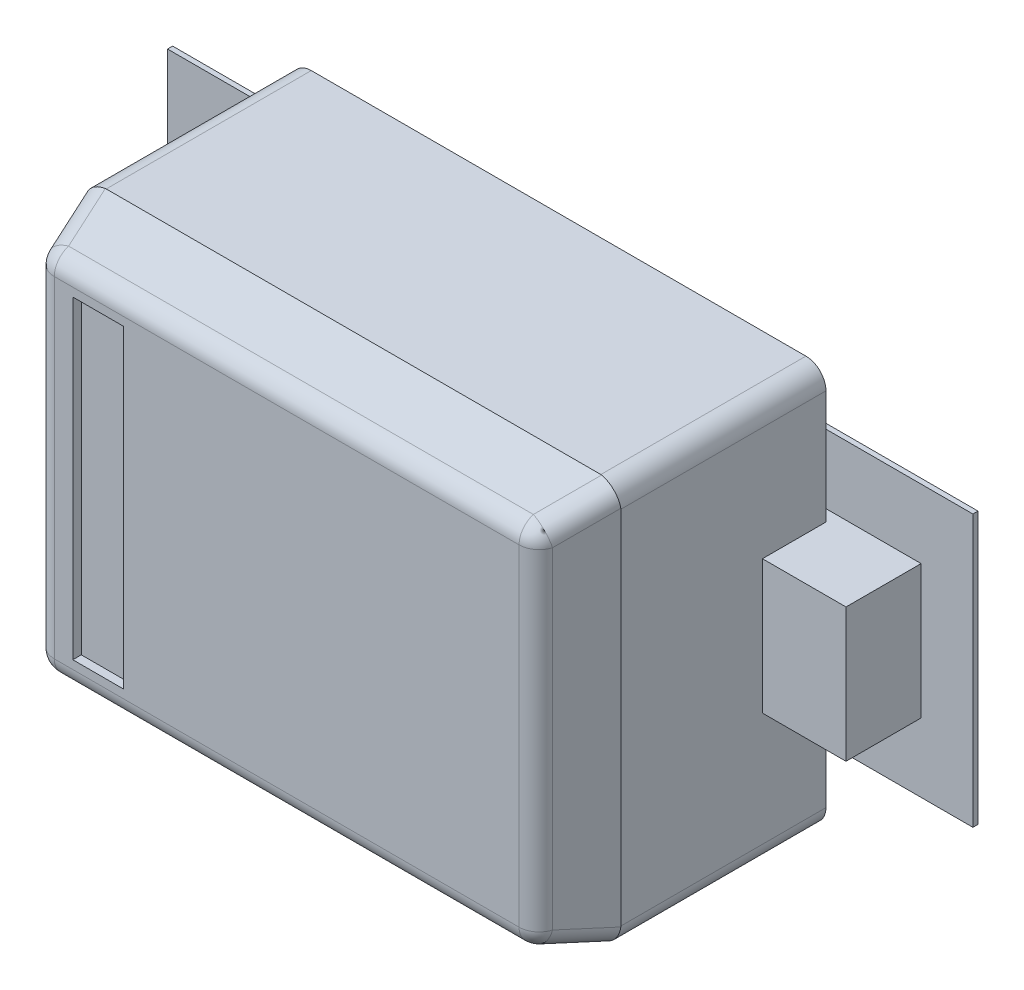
ISO-10303-21;
HEADER;
FILE_DESCRIPTION(('STEP AP214'),'2;1');
FILE_NAME('part.step','',(''),(''),'','','');
FILE_SCHEMA(('AUTOMOTIVE_DESIGN { 1 0 10303 214 1 1 1 1 }'));
ENDSEC;
DATA;
#1=APPLICATION_CONTEXT('core data for automotive mechanical design processes');
#2=APPLICATION_PROTOCOL_DEFINITION('international standard','automotive_design',2000,#1);
#3=PRODUCT_CONTEXT('',#1,'mechanical');
#4=PRODUCT('Part','Part','',(#3));
#5=PRODUCT_RELATED_PRODUCT_CATEGORY('part','',(#4));
#6=PRODUCT_DEFINITION_FORMATION('','',#4);
#7=PRODUCT_DEFINITION_CONTEXT('part definition',#1,'design');
#8=PRODUCT_DEFINITION('design','',#6,#7);
#9=PRODUCT_DEFINITION_SHAPE('','',#8);
#10=(LENGTH_UNIT() NAMED_UNIT(*) SI_UNIT(.MILLI.,.METRE.));
#11=(NAMED_UNIT(*) PLANE_ANGLE_UNIT() SI_UNIT($,.RADIAN.));
#12=(NAMED_UNIT(*) SI_UNIT($,.STERADIAN.) SOLID_ANGLE_UNIT());
#13=UNCERTAINTY_MEASURE_WITH_UNIT(LENGTH_MEASURE(1.E-05),#10,'distance_accuracy_value','');
#14=(GEOMETRIC_REPRESENTATION_CONTEXT(3) GLOBAL_UNCERTAINTY_ASSIGNED_CONTEXT((#13)) GLOBAL_UNIT_ASSIGNED_CONTEXT((#10,
#11,#12)) REPRESENTATION_CONTEXT('',''));
#15=CARTESIAN_POINT('',(0.,0.,0.));
#16=DIRECTION('',(0.,0.,1.));
#17=DIRECTION('',(1.,0.,0.));
#18=AXIS2_PLACEMENT_3D('',#15,#16,#17);
#19=CARTESIAN_POINT('',(0.,-0.30000000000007,0.4953));
#20=DIRECTION('',(0.,0.,1.));
#21=DIRECTION('',(1.,0.,0.));
#22=AXIS2_PLACEMENT_3D('',#19,#20,#21);
#23=PLANE('',#22);
#24=DIRECTION('',(1.,0.,0.));
#25=VECTOR('',#24,1.);
#26=CARTESIAN_POINT('',(-0.31999999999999,-0.235,0.4953));
#27=LINE('',#26,#25);
#28=CARTESIAN_POINT('',(-0.31999999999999,-0.235,0.4953));
#29=VERTEX_POINT('',#28);
#30=CARTESIAN_POINT('',(-0.24379999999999,-0.235,0.4953));
#31=VERTEX_POINT('',#30);
#32=EDGE_CURVE('E619',#29,#31,#27,.T.);
#33=ORIENTED_EDGE('',*,*,#32,.T.);
#34=DIRECTION('',(0.,1.,0.));
#35=VECTOR('',#34,1.);
#36=CARTESIAN_POINT('',(-0.24379999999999,-0.235,0.4953));
#37=LINE('',#36,#35);
#38=CARTESIAN_POINT('',(-0.24379999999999,0.235,0.4953));
#39=VERTEX_POINT('',#38);
#40=EDGE_CURVE('E601',#31,#39,#37,.T.);
#41=ORIENTED_EDGE('',*,*,#40,.T.);
#42=DIRECTION('',(1.,0.,0.));
#43=VECTOR('',#42,1.);
#44=CARTESIAN_POINT('',(-0.24379999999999,0.235,0.4953));
#45=LINE('',#44,#43);
#46=CARTESIAN_POINT('',(-0.31999999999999,0.235,0.4953));
#47=VERTEX_POINT('',#46);
#48=EDGE_CURVE('E610',#39,#47,#45,.F.);
#49=ORIENTED_EDGE('',*,*,#48,.T.);
#50=DIRECTION('',(0.,1.,0.));
#51=VECTOR('',#50,1.);
#52=CARTESIAN_POINT('',(-0.31999999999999,0.235,0.4953));
#53=LINE('',#52,#51);
#54=EDGE_CURVE('E616',#47,#29,#53,.F.);
#55=ORIENTED_EDGE('',*,*,#54,.T.);
#56=EDGE_LOOP('',(#33,#41,#49,#55));
#57=FACE_BOUND('',#56,.T.);
#58=ADVANCED_FACE('F16',(#57),#23,.T.);
#59=CARTESIAN_POINT('',(-0.31999999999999,-0.235,0.508));
#60=DIRECTION('',(0.,-1.,0.));
#61=DIRECTION('',(0.,0.,-1.));
#62=AXIS2_PLACEMENT_3D('',#59,#60,#61);
#63=PLANE('',#62);
#64=ORIENTED_EDGE('',*,*,#32,.F.);
#65=DIRECTION('',(0.,0.,1.));
#66=VECTOR('',#65,1.);
#67=CARTESIAN_POINT('',(-0.31999999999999,-0.235,0.508));
#68=LINE('',#67,#66);
#69=CARTESIAN_POINT('',(-0.31999999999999,-0.235,0.508));
#70=VERTEX_POINT('',#69);
#71=EDGE_CURVE('E613',#29,#70,#68,.T.);
#72=ORIENTED_EDGE('',*,*,#71,.T.);
#73=DIRECTION('',(1.,0.,0.));
#74=VECTOR('',#73,1.);
#75=CARTESIAN_POINT('',(-0.399999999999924,-0.235,0.508));
#76=LINE('',#75,#74);
#77=CARTESIAN_POINT('',(-0.24379999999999,-0.235,0.508));
#78=VERTEX_POINT('',#77);
#79=EDGE_CURVE('E600',#78,#70,#76,.F.);
#80=ORIENTED_EDGE('',*,*,#79,.F.);
#81=DIRECTION('',(0.,0.,-1.));
#82=VECTOR('',#81,1.);
#83=CARTESIAN_POINT('',(-0.24379999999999,-0.235,0.508));
#84=LINE('',#83,#82);
#85=EDGE_CURVE('E604',#78,#31,#84,.T.);
#86=ORIENTED_EDGE('',*,*,#85,.T.);
#87=EDGE_LOOP('',(#64,#72,#80,#86));
#88=FACE_BOUND('',#87,.T.);
#89=ADVANCED_FACE('F312',(#88),#63,.F.);
#90=CARTESIAN_POINT('',(-0.31999999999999,0.235,0.508));
#91=DIRECTION('',(-1.,0.,0.));
#92=DIRECTION('',(0.,0.,1.));
#93=AXIS2_PLACEMENT_3D('',#90,#91,#92);
#94=PLANE('',#93);
#95=ORIENTED_EDGE('',*,*,#54,.F.);
#96=DIRECTION('',(0.,0.,1.));
#97=VECTOR('',#96,1.);
#98=CARTESIAN_POINT('',(-0.31999999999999,0.235,0.508));
#99=LINE('',#98,#97);
#100=CARTESIAN_POINT('',(-0.31999999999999,0.235,0.508));
#101=VERTEX_POINT('',#100);
#102=EDGE_CURVE('E607',#47,#101,#99,.T.);
#103=ORIENTED_EDGE('',*,*,#102,.T.);
#104=DIRECTION('',(0.,1.,0.));
#105=VECTOR('',#104,1.);
#106=CARTESIAN_POINT('',(-0.31999999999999,-0.30000000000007,0.508));
#107=LINE('',#106,#105);
#108=EDGE_CURVE('E1055',#70,#101,#107,.T.);
#109=ORIENTED_EDGE('',*,*,#108,.F.);
#110=ORIENTED_EDGE('',*,*,#71,.F.);
#111=EDGE_LOOP('',(#95,#103,#109,#110));
#112=FACE_BOUND('',#111,.T.);
#113=ADVANCED_FACE('F309',(#112),#94,.F.);
#114=CARTESIAN_POINT('',(-0.24379999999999,0.235,0.508));
#115=DIRECTION('',(0.,1.,0.));
#116=DIRECTION('',(0.,0.,1.));
#117=AXIS2_PLACEMENT_3D('',#114,#115,#116);
#118=PLANE('',#117);
#119=ORIENTED_EDGE('',*,*,#48,.F.);
#120=DIRECTION('',(0.,0.,-1.));
#121=VECTOR('',#120,1.);
#122=CARTESIAN_POINT('',(-0.24379999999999,0.235,0.508));
#123=LINE('',#122,#121);
#124=CARTESIAN_POINT('',(-0.24379999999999,0.235,0.508));
#125=VERTEX_POINT('',#124);
#126=EDGE_CURVE('E598',#39,#125,#123,.F.);
#127=ORIENTED_EDGE('',*,*,#126,.T.);
#128=DIRECTION('',(1.,0.,0.));
#129=VECTOR('',#128,1.);
#130=CARTESIAN_POINT('',(-0.399999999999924,0.235,0.508));
#131=LINE('',#130,#129);
#132=EDGE_CURVE('E77',#101,#125,#131,.T.);
#133=ORIENTED_EDGE('',*,*,#132,.F.);
#134=ORIENTED_EDGE('',*,*,#102,.F.);
#135=EDGE_LOOP('',(#119,#127,#133,#134));
#136=FACE_BOUND('',#135,.T.);
#137=ADVANCED_FACE('F305',(#136),#118,.F.);
#138=CARTESIAN_POINT('',(-0.24379999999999,-0.235,0.508));
#139=DIRECTION('',(1.,0.,0.));
#140=DIRECTION('',(0.,0.,-1.));
#141=AXIS2_PLACEMENT_3D('',#138,#139,#140);
#142=PLANE('',#141);
#143=ORIENTED_EDGE('',*,*,#40,.F.);
#144=ORIENTED_EDGE('',*,*,#85,.F.);
#145=DIRECTION('',(0.,1.,0.));
#146=VECTOR('',#145,1.);
#147=CARTESIAN_POINT('',(-0.24379999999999,-0.30000000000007,0.508));
#148=LINE('',#147,#146);
#149=EDGE_CURVE('E1052',#125,#78,#148,.F.);
#150=ORIENTED_EDGE('',*,*,#149,.F.);
#151=ORIENTED_EDGE('',*,*,#126,.F.);
#152=EDGE_LOOP('',(#143,#144,#150,#151));
#153=FACE_BOUND('',#152,.T.);
#154=ADVANCED_FACE('F302',(#153),#142,.F.);
#155=CARTESIAN_POINT('',(-0.32499999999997,-0.100000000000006,0.0762));
#156=DIRECTION('',(0.,0.,-1.));
#157=DIRECTION('',(-1.,0.,0.));
#158=AXIS2_PLACEMENT_3D('',#155,#156,#157);
#159=PLANE('',#158);
#160=DIRECTION('',(0.,1.,0.));
#161=VECTOR('',#160,1.);
#162=CARTESIAN_POINT('',(-0.602488,0.2029968,0.0762));
#163=LINE('',#162,#161);
#164=CARTESIAN_POINT('',(-0.602488,0.2029968,0.0762));
#165=VERTEX_POINT('',#164);
#166=CARTESIAN_POINT('',(-0.602488,-0.2029968,0.0762));
#167=VERTEX_POINT('',#166);
#168=EDGE_CURVE('E248',#165,#167,#163,.F.);
#169=ORIENTED_EDGE('',*,*,#168,.F.);
#170=DIRECTION('',(1.,0.,0.));
#171=VECTOR('',#170,1.);
#172=CARTESIAN_POINT('',(-0.2975102,0.2029968,0.0762));
#173=LINE('',#172,#171);
#174=CARTESIAN_POINT('',(-0.2975102,0.2029968,0.0762));
#175=VERTEX_POINT('',#174);
#176=EDGE_CURVE('E559',#175,#165,#173,.F.);
#177=ORIENTED_EDGE('',*,*,#176,.F.);
#178=DIRECTION('',(0.,1.,0.));
#179=VECTOR('',#178,1.);
#180=CARTESIAN_POINT('',(-0.2975102,-0.2029968,0.0762));
#181=LINE('',#180,#179);
#182=CARTESIAN_POINT('',(-0.2975102,-0.2029968,0.0762));
#183=VERTEX_POINT('',#182);
#184=EDGE_CURVE('E266',#183,#175,#181,.T.);
#185=ORIENTED_EDGE('',*,*,#184,.F.);
#186=DIRECTION('',(1.,0.,0.));
#187=VECTOR('',#186,1.);
#188=CARTESIAN_POINT('',(-0.602488,-0.2029968,0.0762));
#189=LINE('',#188,#187);
#190=EDGE_CURVE('E242',#167,#183,#189,.T.);
#191=ORIENTED_EDGE('',*,*,#190,.F.);
#192=EDGE_LOOP('',(#169,#177,#185,#191));
#193=FACE_BOUND('',#192,.T.);
#194=ADVANCED_FACE('F265',(#193),#159,.T.);
#195=CARTESIAN_POINT('',(-0.32499999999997,-0.100000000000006,0.0762));
#196=DIRECTION('',(0.,0.,-1.));
#197=DIRECTION('',(-1.,0.,0.));
#198=AXIS2_PLACEMENT_3D('',#195,#196,#197);
#199=PLANE('',#198);
#200=DIRECTION('',(0.,1.,0.));
#201=VECTOR('',#200,1.);
#202=CARTESIAN_POINT('',(0.2975102,0.2029968,0.0762));
#203=LINE('',#202,#201);
#204=CARTESIAN_POINT('',(0.2975102,0.2029968,0.0762));
#205=VERTEX_POINT('',#204);
#206=CARTESIAN_POINT('',(0.2975102,-0.2029968,0.0762));
#207=VERTEX_POINT('',#206);
#208=EDGE_CURVE('E211',#205,#207,#203,.F.);
#209=ORIENTED_EDGE('',*,*,#208,.F.);
#210=DIRECTION('',(1.,0.,0.));
#211=VECTOR('',#210,1.);
#212=CARTESIAN_POINT('',(0.602488,0.2029968,0.0762));
#213=LINE('',#212,#211);
#214=CARTESIAN_POINT('',(0.602488,0.2029968,0.0762));
#215=VERTEX_POINT('',#214);
#216=EDGE_CURVE('E659',#215,#205,#213,.F.);
#217=ORIENTED_EDGE('',*,*,#216,.F.);
#218=DIRECTION('',(0.,1.,0.));
#219=VECTOR('',#218,1.);
#220=CARTESIAN_POINT('',(0.602488,-0.2029968,0.0762));
#221=LINE('',#220,#219);
#222=CARTESIAN_POINT('',(0.602488,-0.2029968,0.0762));
#223=VERTEX_POINT('',#222);
#224=EDGE_CURVE('E726',#223,#215,#221,.T.);
#225=ORIENTED_EDGE('',*,*,#224,.F.);
#226=DIRECTION('',(1.,0.,0.));
#227=VECTOR('',#226,1.);
#228=CARTESIAN_POINT('',(0.2975102,-0.2029968,0.0762));
#229=LINE('',#228,#227);
#230=EDGE_CURVE('E711',#207,#223,#229,.T.);
#231=ORIENTED_EDGE('',*,*,#230,.F.);
#232=EDGE_LOOP('',(#209,#217,#225,#231));
#233=FACE_BOUND('',#232,.T.);
#234=ADVANCED_FACE('F296',(#233),#199,.T.);
#235=CARTESIAN_POINT('',(-0.399999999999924,-0.30000000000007,0.508));
#236=DIRECTION('',(0.,0.,1.));
#237=DIRECTION('',(1.,0.,0.));
#238=AXIS2_PLACEMENT_3D('',#235,#236,#237);
#239=PLANE('',#238);
#240=ORIENTED_EDGE('',*,*,#132,.T.);
#241=ORIENTED_EDGE('',*,*,#149,.T.);
#242=ORIENTED_EDGE('',*,*,#79,.T.);
#243=ORIENTED_EDGE('',*,*,#108,.T.);
#244=EDGE_LOOP('',(#240,#241,#242,#243));
#245=FACE_BOUND('',#244,.T.);
#246=DIRECTION('',(0.,1.,0.));
#247=VECTOR('',#246,1.);
#248=CARTESIAN_POINT('',(0.347679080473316,-1.1723147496,0.508000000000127));
#249=LINE('',#248,#247);
#250=CARTESIAN_POINT('',(0.347679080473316,0.247679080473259,0.508000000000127));
#251=VERTEX_POINT('',#250);
#252=CARTESIAN_POINT('',(0.347679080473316,-0.247679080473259,0.508000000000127));
#253=VERTEX_POINT('',#252);
#254=EDGE_CURVE('E593',#251,#253,#249,.F.);
#255=ORIENTED_EDGE('',*,*,#254,.F.);
#256=DIRECTION('',(-1.,0.,0.));
#257=VECTOR('',#256,1.);
#258=CARTESIAN_POINT('',(2.463350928,0.247679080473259,0.508000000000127));
#259=LINE('',#258,#257);
#260=CARTESIAN_POINT('',(-0.347679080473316,0.247679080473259,0.508000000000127));
#261=VERTEX_POINT('',#260);
#262=EDGE_CURVE('E68',#261,#251,#259,.F.);
#263=ORIENTED_EDGE('',*,*,#262,.F.);
#264=DIRECTION('',(0.,-1.,0.));
#265=VECTOR('',#264,1.);
#266=CARTESIAN_POINT('',(-0.347679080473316,1.1723147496,0.508000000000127));
#267=LINE('',#266,#265);
#268=CARTESIAN_POINT('',(-0.347679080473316,-0.247679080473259,0.508000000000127));
#269=VERTEX_POINT('',#268);
#270=EDGE_CURVE('E556',#269,#261,#267,.F.);
#271=ORIENTED_EDGE('',*,*,#270,.F.);
#272=DIRECTION('',(1.,0.,0.));
#273=VECTOR('',#272,1.);
#274=CARTESIAN_POINT('',(-2.685854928,-0.247679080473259,0.508000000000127));
#275=LINE('',#274,#273);
#276=EDGE_CURVE('E661',#253,#269,#275,.F.);
#277=ORIENTED_EDGE('',*,*,#276,.F.);
#278=EDGE_LOOP('',(#255,#263,#271,#277));
#279=FACE_BOUND('',#278,.T.);
#280=ADVANCED_FACE('F292',(#245,#279),#239,.T.);
#281=CARTESIAN_POINT('',(0.347679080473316,0.247679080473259,0.47800000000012));
#282=DIRECTION('',(0.650944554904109,0.650944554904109,0.390566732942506));
#283=DIRECTION('',(-0.276172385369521,-0.276172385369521,0.920574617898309));
#284=AXIS2_PLACEMENT_3D('',#281,#282,#283);
#285=SPHERICAL_SURFACE('',#284,0.030000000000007);
#286=CARTESIAN_POINT('',(0.347679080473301,0.247679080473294,0.477999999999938));
#287=DIRECTION('',(0.276172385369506,0.276172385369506,-0.920574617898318));
#288=DIRECTION('',(-0.957826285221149,0.,-0.287347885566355));
#289=AXIS2_PLACEMENT_3D('',#286,#287,#288);
#290=CIRCLE('',#289,0.030000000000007);
#291=CARTESIAN_POINT('',(0.347679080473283,0.276413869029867,0.486620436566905));
#292=VERTEX_POINT('',#291);
#293=CARTESIAN_POINT('',(0.367207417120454,0.267207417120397,0.489717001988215));
#294=VERTEX_POINT('',#293);
#295=EDGE_CURVE('E654',#292,#294,#290,.T.);
#296=ORIENTED_EDGE('',*,*,#295,.F.);
#297=CARTESIAN_POINT('',(0.347679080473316,0.247679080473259,0.47800000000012));
#298=DIRECTION('',(-1.,0.,0.));
#299=DIRECTION('',(0.,0.,1.));
#300=AXIS2_PLACEMENT_3D('',#297,#298,#299);
#301=CIRCLE('',#300,0.030000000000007);
#302=EDGE_CURVE('E19',#251,#292,#301,.T.);
#303=ORIENTED_EDGE('',*,*,#302,.F.);
#304=CARTESIAN_POINT('',(0.347679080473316,0.247679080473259,0.47800000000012));
#305=DIRECTION('',(0.,1.,0.));
#306=DIRECTION('',(0.,0.,1.));
#307=AXIS2_PLACEMENT_3D('',#304,#305,#306);
#308=CIRCLE('',#307,0.030000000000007);
#309=CARTESIAN_POINT('',(0.376413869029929,0.247679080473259,0.486620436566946));
#310=VERTEX_POINT('',#309);
#311=EDGE_CURVE('E655',#310,#251,#308,.F.);
#312=ORIENTED_EDGE('',*,*,#311,.F.);
#313=CARTESIAN_POINT('',(0.347679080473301,0.247679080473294,0.477999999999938));
#314=DIRECTION('',(0.276172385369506,0.276172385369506,-0.920574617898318));
#315=DIRECTION('',(-0.957826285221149,0.,-0.287347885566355));
#316=AXIS2_PLACEMENT_3D('',#313,#314,#315);
#317=CIRCLE('',#316,0.030000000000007);
#318=EDGE_CURVE('E652',#294,#310,#317,.T.);
#319=ORIENTED_EDGE('',*,*,#318,.F.);
#320=EDGE_LOOP('',(#296,#303,#312,#319));
#321=FACE_BOUND('',#320,.T.);
#322=ADVANCED_FACE('F287',(#321),#285,.T.);
#323=CARTESIAN_POINT('',(-0.347679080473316,0.247679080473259,0.47800000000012));
#324=DIRECTION('',(-0.596930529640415,0.,0.802292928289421));
#325=DIRECTION('',(0.,1.,0.));
#326=AXIS2_PLACEMENT_3D('',#323,#324,#325);
#327=SPHERICAL_SURFACE('',#326,0.030000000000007);
#328=CARTESIAN_POINT('',(-0.347679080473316,0.247679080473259,0.47800000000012));
#329=DIRECTION('',(0.,-1.,0.));
#330=DIRECTION('',(0.,0.,-1.));
#331=AXIS2_PLACEMENT_3D('',#328,#329,#330);
#332=CIRCLE('',#331,0.030000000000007);
#333=CARTESIAN_POINT('',(-0.365586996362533,0.247679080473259,0.502068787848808));
#334=VERTEX_POINT('',#333);
#335=EDGE_CURVE('E34',#261,#334,#332,.T.);
#336=ORIENTED_EDGE('',*,*,#335,.F.);
#337=CARTESIAN_POINT('',(-0.347679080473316,0.247679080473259,0.47800000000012));
#338=DIRECTION('',(-1.,0.,0.));
#339=DIRECTION('',(0.,0.,1.));
#340=AXIS2_PLACEMENT_3D('',#337,#338,#339);
#341=CIRCLE('',#340,0.030000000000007);
#342=CARTESIAN_POINT('',(-0.347679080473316,0.27641386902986,0.486620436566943));
#343=VERTEX_POINT('',#342);
#344=EDGE_CURVE('E582',#343,#261,#341,.F.);
#345=ORIENTED_EDGE('',*,*,#344,.F.);
#346=CARTESIAN_POINT('',(-0.347679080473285,0.247679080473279,0.477999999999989));
#347=DIRECTION('',(-0.276172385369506,0.276172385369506,-0.920574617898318));
#348=DIRECTION('',(-0.957826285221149,0.,0.287347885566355));
#349=AXIS2_PLACEMENT_3D('',#346,#347,#348);
#350=CIRCLE('',#349,0.030000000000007);
#351=CARTESIAN_POINT('',(-0.376413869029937,0.247679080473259,0.486620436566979));
#352=VERTEX_POINT('',#351);
#353=EDGE_CURVE('E650',#352,#343,#350,.T.);
#354=ORIENTED_EDGE('',*,*,#353,.F.);
#355=CARTESIAN_POINT('',(-0.347679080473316,0.247679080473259,0.47800000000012));
#356=DIRECTION('',(0.,-1.,0.));
#357=DIRECTION('',(0.,0.,-1.));
#358=AXIS2_PLACEMENT_3D('',#355,#356,#357);
#359=CIRCLE('',#358,0.030000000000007);
#360=EDGE_CURVE('E555',#334,#352,#359,.T.);
#361=ORIENTED_EDGE('',*,*,#360,.F.);
#362=EDGE_LOOP('',(#336,#345,#354,#361));
#363=FACE_BOUND('',#362,.T.);
#364=ADVANCED_FACE('F282',(#363),#327,.T.);
#365=CARTESIAN_POINT('',(2.463350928,0.247679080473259,0.47800000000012));
#366=DIRECTION('',(-1.,0.,0.));
#367=DIRECTION('',(0.,0.,1.));
#368=AXIS2_PLACEMENT_3D('',#365,#366,#367);
#369=CYLINDRICAL_SURFACE('',#368,0.030000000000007);
#370=ORIENTED_EDGE('',*,*,#344,.T.);
#371=ORIENTED_EDGE('',*,*,#262,.T.);
#372=ORIENTED_EDGE('',*,*,#302,.T.);
#373=DIRECTION('',(1.,0.,0.));
#374=VECTOR('',#373,1.);
#375=CARTESIAN_POINT('',(0.,0.276413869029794,0.486620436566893));
#376=LINE('',#375,#374);
#377=EDGE_CURVE('E272',#343,#292,#376,.T.);
#378=ORIENTED_EDGE('',*,*,#377,.F.);
#379=EDGE_LOOP('',(#370,#371,#372,#378));
#380=FACE_BOUND('',#379,.T.);
#381=ADVANCED_FACE('F286',(#380),#369,.T.);
#382=CARTESIAN_POINT('',(-0.602488,0.2029968,0.0762));
#383=DIRECTION('',(-1.,0.,0.));
#384=DIRECTION('',(0.,0.,1.));
#385=AXIS2_PLACEMENT_3D('',#382,#383,#384);
#386=PLANE('',#385);
#387=DIRECTION('',(0.,0.,1.));
#388=VECTOR('',#387,1.);
#389=CARTESIAN_POINT('',(-0.602488,0.2029968,0.0762));
#390=LINE('',#389,#388);
#391=CARTESIAN_POINT('',(-0.602488,0.2029968,0.08382));
#392=VERTEX_POINT('',#391);
#393=EDGE_CURVE('E255',#165,#392,#390,.T.);
#394=ORIENTED_EDGE('',*,*,#393,.F.);
#395=ORIENTED_EDGE('',*,*,#168,.T.);
#396=DIRECTION('',(0.,0.,-1.));
#397=VECTOR('',#396,1.);
#398=CARTESIAN_POINT('',(-0.602488,-0.2029968,0.0762));
#399=LINE('',#398,#397);
#400=CARTESIAN_POINT('',(-0.602488,-0.2029968,0.08382));
#401=VERTEX_POINT('',#400);
#402=EDGE_CURVE('E252',#401,#167,#399,.T.);
#403=ORIENTED_EDGE('',*,*,#402,.F.);
#404=DIRECTION('',(0.,1.,0.));
#405=VECTOR('',#404,1.);
#406=CARTESIAN_POINT('',(-0.602488,0.,0.08382));
#407=LINE('',#406,#405);
#408=EDGE_CURVE('E766',#392,#401,#407,.F.);
#409=ORIENTED_EDGE('',*,*,#408,.F.);
#410=EDGE_LOOP('',(#394,#395,#403,#409));
#411=FACE_BOUND('',#410,.T.);
#412=ADVANCED_FACE('F249',(#411),#386,.T.);
#413=CARTESIAN_POINT('',(-0.602488,-0.2029968,0.0762));
#414=DIRECTION('',(0.,-1.,0.));
#415=DIRECTION('',(0.,0.,-1.));
#416=AXIS2_PLACEMENT_3D('',#413,#414,#415);
#417=PLANE('',#416);
#418=ORIENTED_EDGE('',*,*,#402,.T.);
#419=ORIENTED_EDGE('',*,*,#190,.T.);
#420=DIRECTION('',(0.,0.,-1.));
#421=VECTOR('',#420,1.);
#422=CARTESIAN_POINT('',(-0.2975102,-0.2029968,0.0762));
#423=LINE('',#422,#421);
#424=CARTESIAN_POINT('',(-0.2975102,-0.2029968,0.08382));
#425=VERTEX_POINT('',#424);
#426=EDGE_CURVE('E267',#425,#183,#423,.T.);
#427=ORIENTED_EDGE('',*,*,#426,.F.);
#428=DIRECTION('',(1.,0.,0.));
#429=VECTOR('',#428,1.);
#430=CARTESIAN_POINT('',(0.,-0.2029968,0.08382));
#431=LINE('',#430,#429);
#432=EDGE_CURVE('E262',#401,#425,#431,.T.);
#433=ORIENTED_EDGE('',*,*,#432,.F.);
#434=EDGE_LOOP('',(#418,#419,#427,#433));
#435=FACE_BOUND('',#434,.T.);
#436=ADVANCED_FACE('F260',(#435),#417,.T.);
#437=CARTESIAN_POINT('',(-0.2975102,-0.2029968,0.0762));
#438=DIRECTION('',(1.,0.,0.));
#439=DIRECTION('',(0.,0.,-1.));
#440=AXIS2_PLACEMENT_3D('',#437,#438,#439);
#441=PLANE('',#440);
#442=ORIENTED_EDGE('',*,*,#426,.T.);
#443=ORIENTED_EDGE('',*,*,#184,.T.);
#444=DIRECTION('',(0.,0.,1.));
#445=VECTOR('',#444,1.);
#446=CARTESIAN_POINT('',(-0.2975102,0.2029968,0.0762));
#447=LINE('',#446,#445);
#448=CARTESIAN_POINT('',(-0.2975102,0.2029968,0.08382));
#449=VERTEX_POINT('',#448);
#450=EDGE_CURVE('E666',#449,#175,#447,.F.);
#451=ORIENTED_EDGE('',*,*,#450,.F.);
#452=DIRECTION('',(0.,1.,0.));
#453=VECTOR('',#452,1.);
#454=CARTESIAN_POINT('',(-0.2975102,0.,0.08382));
#455=LINE('',#454,#453);
#456=EDGE_CURVE('E674',#425,#449,#455,.T.);
#457=ORIENTED_EDGE('',*,*,#456,.F.);
#458=EDGE_LOOP('',(#442,#443,#451,#457));
#459=FACE_BOUND('',#458,.T.);
#460=ADVANCED_FACE('F568',(#459),#441,.T.);
#461=CARTESIAN_POINT('',(-0.2975102,0.2029968,0.0762));
#462=DIRECTION('',(0.,1.,0.));
#463=DIRECTION('',(0.,0.,1.));
#464=AXIS2_PLACEMENT_3D('',#461,#462,#463);
#465=PLANE('',#464);
#466=ORIENTED_EDGE('',*,*,#450,.T.);
#467=ORIENTED_EDGE('',*,*,#176,.T.);
#468=ORIENTED_EDGE('',*,*,#393,.T.);
#469=DIRECTION('',(1.,0.,0.));
#470=VECTOR('',#469,1.);
#471=CARTESIAN_POINT('',(0.,0.2029968,0.08382));
#472=LINE('',#471,#470);
#473=EDGE_CURVE('E745',#449,#392,#472,.F.);
#474=ORIENTED_EDGE('',*,*,#473,.F.);
#475=EDGE_LOOP('',(#466,#467,#468,#474));
#476=FACE_BOUND('',#475,.T.);
#477=ADVANCED_FACE('F564',(#476),#465,.T.);
#478=CARTESIAN_POINT('',(-0.347679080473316,-0.247679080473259,0.47800000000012));
#479=DIRECTION('',(-0.650944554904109,-0.650944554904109,0.390566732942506));
#480=DIRECTION('',(0.276172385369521,0.276172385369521,0.920574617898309));
#481=AXIS2_PLACEMENT_3D('',#478,#479,#480);
#482=SPHERICAL_SURFACE('',#481,0.030000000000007);
#483=CARTESIAN_POINT('',(-0.347679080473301,-0.247679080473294,0.477999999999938));
#484=DIRECTION('',(-0.276172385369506,-0.276172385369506,-0.920574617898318));
#485=DIRECTION('',(-0.957826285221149,0.,0.287347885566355));
#486=AXIS2_PLACEMENT_3D('',#483,#484,#485);
#487=CIRCLE('',#486,0.030000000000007);
#488=CARTESIAN_POINT('',(-0.367207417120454,-0.267207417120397,0.489717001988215));
#489=VERTEX_POINT('',#488);
#490=CARTESIAN_POINT('',(-0.376413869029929,-0.247679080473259,0.486620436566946));
#491=VERTEX_POINT('',#490);
#492=EDGE_CURVE('E647',#489,#491,#487,.T.);
#493=ORIENTED_EDGE('',*,*,#492,.F.);
#494=CARTESIAN_POINT('',(-0.347679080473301,-0.247679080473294,0.477999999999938));
#495=DIRECTION('',(-0.276172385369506,-0.276172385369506,-0.920574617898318));
#496=DIRECTION('',(-0.957826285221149,0.,0.287347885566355));
#497=AXIS2_PLACEMENT_3D('',#494,#495,#496);
#498=CIRCLE('',#497,0.030000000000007);
#499=CARTESIAN_POINT('',(-0.347679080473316,-0.276413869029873,0.486620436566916));
#500=VERTEX_POINT('',#499);
#501=EDGE_CURVE('E649',#500,#489,#498,.T.);
#502=ORIENTED_EDGE('',*,*,#501,.F.);
#503=CARTESIAN_POINT('',(-0.347679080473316,-0.247679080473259,0.47800000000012));
#504=DIRECTION('',(1.,0.,0.));
#505=DIRECTION('',(0.,0.,-1.));
#506=AXIS2_PLACEMENT_3D('',#503,#504,#505);
#507=CIRCLE('',#506,0.030000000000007);
#508=EDGE_CURVE('E662',#269,#500,#507,.T.);
#509=ORIENTED_EDGE('',*,*,#508,.F.);
#510=CARTESIAN_POINT('',(-0.347679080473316,-0.247679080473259,0.47800000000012));
#511=DIRECTION('',(0.,-1.,0.));
#512=DIRECTION('',(0.,0.,-1.));
#513=AXIS2_PLACEMENT_3D('',#510,#511,#512);
#514=CIRCLE('',#513,0.030000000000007);
#515=EDGE_CURVE('E587',#491,#269,#514,.F.);
#516=ORIENTED_EDGE('',*,*,#515,.F.);
#517=EDGE_LOOP('',(#493,#502,#509,#516));
#518=FACE_BOUND('',#517,.T.);
#519=ADVANCED_FACE('F561',(#518),#482,.T.);
#520=CARTESIAN_POINT('',(-0.347679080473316,1.1723147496,0.47800000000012));
#521=DIRECTION('',(0.,-1.,0.));
#522=DIRECTION('',(0.,0.,-1.));
#523=AXIS2_PLACEMENT_3D('',#520,#521,#522);
#524=CYLINDRICAL_SURFACE('',#523,0.030000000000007);
#525=ORIENTED_EDGE('',*,*,#360,.T.);
#526=DIRECTION('',(0.,1.,0.));
#527=VECTOR('',#526,1.);
#528=CARTESIAN_POINT('',(-0.376413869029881,0.,0.486620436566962));
#529=LINE('',#528,#527);
#530=EDGE_CURVE('E549',#491,#352,#529,.T.);
#531=ORIENTED_EDGE('',*,*,#530,.F.);
#532=ORIENTED_EDGE('',*,*,#515,.T.);
#533=ORIENTED_EDGE('',*,*,#270,.T.);
#534=ORIENTED_EDGE('',*,*,#335,.T.);
#535=EDGE_LOOP('',(#525,#531,#532,#533,#534));
#536=FACE_BOUND('',#535,.T.);
#537=ADVANCED_FACE('F541',(#536),#524,.T.);
#538=CARTESIAN_POINT('',(0.347679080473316,-0.247679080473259,0.47800000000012));
#539=DIRECTION('',(0.650944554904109,-0.650944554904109,0.390566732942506));
#540=DIRECTION('',(-0.276172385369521,0.276172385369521,0.920574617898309));
#541=AXIS2_PLACEMENT_3D('',#538,#539,#540);
#542=SPHERICAL_SURFACE('',#541,0.030000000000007);
#543=CARTESIAN_POINT('',(0.347679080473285,-0.247679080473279,0.477999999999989));
#544=DIRECTION('',(0.276172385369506,-0.276172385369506,-0.920574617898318));
#545=DIRECTION('',(-0.957826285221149,0.,-0.287347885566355));
#546=AXIS2_PLACEMENT_3D('',#543,#544,#545);
#547=CIRCLE('',#546,0.030000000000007);
#548=CARTESIAN_POINT('',(0.376413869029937,-0.247679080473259,0.486620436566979));
#549=VERTEX_POINT('',#548);
#550=CARTESIAN_POINT('',(0.367207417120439,-0.267207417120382,0.489717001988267));
#551=VERTEX_POINT('',#550);
#552=EDGE_CURVE('E646',#549,#551,#547,.T.);
#553=ORIENTED_EDGE('',*,*,#552,.F.);
#554=CARTESIAN_POINT('',(0.347679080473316,-0.247679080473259,0.47800000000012));
#555=DIRECTION('',(0.,1.,0.));
#556=DIRECTION('',(0.,0.,1.));
#557=AXIS2_PLACEMENT_3D('',#554,#555,#556);
#558=CIRCLE('',#557,0.030000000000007);
#559=EDGE_CURVE('E657',#253,#549,#558,.T.);
#560=ORIENTED_EDGE('',*,*,#559,.F.);
#561=CARTESIAN_POINT('',(0.347679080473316,-0.247679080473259,0.47800000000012));
#562=DIRECTION('',(1.,0.,0.));
#563=DIRECTION('',(0.,0.,-1.));
#564=AXIS2_PLACEMENT_3D('',#561,#562,#563);
#565=CIRCLE('',#564,0.030000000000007);
#566=CARTESIAN_POINT('',(0.347679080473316,-0.27641386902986,0.486620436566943));
#567=VERTEX_POINT('',#566);
#568=EDGE_CURVE('E202',#567,#253,#565,.F.);
#569=ORIENTED_EDGE('',*,*,#568,.F.);
#570=CARTESIAN_POINT('',(0.347679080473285,-0.247679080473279,0.477999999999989));
#571=DIRECTION('',(0.276172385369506,-0.276172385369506,-0.920574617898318));
#572=DIRECTION('',(-0.957826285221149,0.,-0.287347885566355));
#573=AXIS2_PLACEMENT_3D('',#570,#571,#572);
#574=CIRCLE('',#573,0.030000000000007);
#575=EDGE_CURVE('E643',#551,#567,#574,.T.);
#576=ORIENTED_EDGE('',*,*,#575,.F.);
#577=EDGE_LOOP('',(#553,#560,#569,#576));
#578=FACE_BOUND('',#577,.T.);
#579=ADVANCED_FACE('F537',(#578),#542,.T.);
#580=CARTESIAN_POINT('',(-2.685854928,-0.247679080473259,0.47800000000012));
#581=DIRECTION('',(1.,0.,0.));
#582=DIRECTION('',(0.,0.,-1.));
#583=AXIS2_PLACEMENT_3D('',#580,#581,#582);
#584=CYLINDRICAL_SURFACE('',#583,0.030000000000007);
#585=ORIENTED_EDGE('',*,*,#568,.T.);
#586=ORIENTED_EDGE('',*,*,#276,.T.);
#587=ORIENTED_EDGE('',*,*,#508,.T.);
#588=DIRECTION('',(1.,0.,0.));
#589=VECTOR('',#588,1.);
#590=CARTESIAN_POINT('',(0.,-0.276413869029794,0.486620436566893));
#591=LINE('',#590,#589);
#592=EDGE_CURVE('E547',#567,#500,#591,.F.);
#593=ORIENTED_EDGE('',*,*,#592,.F.);
#594=EDGE_LOOP('',(#585,#586,#587,#593));
#595=FACE_BOUND('',#594,.T.);
#596=ADVANCED_FACE('F534',(#595),#584,.T.);
#597=CARTESIAN_POINT('',(0.2975102,0.2029968,0.0762));
#598=DIRECTION('',(-1.,0.,0.));
#599=DIRECTION('',(0.,0.,1.));
#600=AXIS2_PLACEMENT_3D('',#597,#598,#599);
#601=PLANE('',#600);
#602=DIRECTION('',(0.,0.,1.));
#603=VECTOR('',#602,1.);
#604=CARTESIAN_POINT('',(0.2975102,0.2029968,0.0762));
#605=LINE('',#604,#603);
#606=CARTESIAN_POINT('',(0.2975102,0.2029968,0.08382));
#607=VERTEX_POINT('',#606);
#608=EDGE_CURVE('E718',#205,#607,#605,.T.);
#609=ORIENTED_EDGE('',*,*,#608,.F.);
#610=ORIENTED_EDGE('',*,*,#208,.T.);
#611=DIRECTION('',(0.,0.,-1.));
#612=VECTOR('',#611,1.);
#613=CARTESIAN_POINT('',(0.2975102,-0.2029968,0.0762));
#614=LINE('',#613,#612);
#615=CARTESIAN_POINT('',(0.2975102,-0.2029968,0.08382));
#616=VERTEX_POINT('',#615);
#617=EDGE_CURVE('E712',#616,#207,#614,.T.);
#618=ORIENTED_EDGE('',*,*,#617,.F.);
#619=DIRECTION('',(0.,1.,0.));
#620=VECTOR('',#619,1.);
#621=CARTESIAN_POINT('',(0.2975102,0.,0.08382));
#622=LINE('',#621,#620);
#623=EDGE_CURVE('E725',#607,#616,#622,.F.);
#624=ORIENTED_EDGE('',*,*,#623,.F.);
#625=EDGE_LOOP('',(#609,#610,#618,#624));
#626=FACE_BOUND('',#625,.T.);
#627=ADVANCED_FACE('F530',(#626),#601,.T.);
#628=CARTESIAN_POINT('',(0.2975102,-0.2029968,0.0762));
#629=DIRECTION('',(0.,-1.,0.));
#630=DIRECTION('',(0.,0.,-1.));
#631=AXIS2_PLACEMENT_3D('',#628,#629,#630);
#632=PLANE('',#631);
#633=ORIENTED_EDGE('',*,*,#617,.T.);
#634=ORIENTED_EDGE('',*,*,#230,.T.);
#635=DIRECTION('',(0.,0.,-1.));
#636=VECTOR('',#635,1.);
#637=CARTESIAN_POINT('',(0.602488,-0.2029968,0.0762));
#638=LINE('',#637,#636);
#639=CARTESIAN_POINT('',(0.602488,-0.2029968,0.08382));
#640=VERTEX_POINT('',#639);
#641=EDGE_CURVE('E729',#640,#223,#638,.T.);
#642=ORIENTED_EDGE('',*,*,#641,.F.);
#643=DIRECTION('',(1.,0.,0.));
#644=VECTOR('',#643,1.);
#645=CARTESIAN_POINT('',(0.,-0.2029968,0.08382));
#646=LINE('',#645,#644);
#647=EDGE_CURVE('E803',#616,#640,#646,.T.);
#648=ORIENTED_EDGE('',*,*,#647,.F.);
#649=EDGE_LOOP('',(#633,#634,#642,#648));
#650=FACE_BOUND('',#649,.T.);
#651=ADVANCED_FACE('F526',(#650),#632,.T.);
#652=CARTESIAN_POINT('',(0.602488,-0.2029968,0.0762));
#653=DIRECTION('',(1.,0.,0.));
#654=DIRECTION('',(0.,0.,-1.));
#655=AXIS2_PLACEMENT_3D('',#652,#653,#654);
#656=PLANE('',#655);
#657=ORIENTED_EDGE('',*,*,#641,.T.);
#658=ORIENTED_EDGE('',*,*,#224,.T.);
#659=DIRECTION('',(0.,0.,1.));
#660=VECTOR('',#659,1.);
#661=CARTESIAN_POINT('',(0.602488,0.2029968,0.0762));
#662=LINE('',#661,#660);
#663=CARTESIAN_POINT('',(0.602488,0.2029968,0.08382));
#664=VERTEX_POINT('',#663);
#665=EDGE_CURVE('E721',#664,#215,#662,.F.);
#666=ORIENTED_EDGE('',*,*,#665,.F.);
#667=DIRECTION('',(0.,1.,0.));
#668=VECTOR('',#667,1.);
#669=CARTESIAN_POINT('',(0.602488,0.,0.08382));
#670=LINE('',#669,#668);
#671=EDGE_CURVE('E954',#640,#664,#670,.T.);
#672=ORIENTED_EDGE('',*,*,#671,.F.);
#673=EDGE_LOOP('',(#657,#658,#666,#672));
#674=FACE_BOUND('',#673,.T.);
#675=ADVANCED_FACE('F522',(#674),#656,.T.);
#676=CARTESIAN_POINT('',(0.602488,0.2029968,0.0762));
#677=DIRECTION('',(0.,1.,0.));
#678=DIRECTION('',(0.,0.,1.));
#679=AXIS2_PLACEMENT_3D('',#676,#677,#678);
#680=PLANE('',#679);
#681=ORIENTED_EDGE('',*,*,#665,.T.);
#682=ORIENTED_EDGE('',*,*,#216,.T.);
#683=ORIENTED_EDGE('',*,*,#608,.T.);
#684=DIRECTION('',(1.,0.,0.));
#685=VECTOR('',#684,1.);
#686=CARTESIAN_POINT('',(0.,0.2029968,0.08382));
#687=LINE('',#686,#685);
#688=EDGE_CURVE('E952',#664,#607,#687,.F.);
#689=ORIENTED_EDGE('',*,*,#688,.F.);
#690=EDGE_LOOP('',(#681,#682,#683,#689));
#691=FACE_BOUND('',#690,.T.);
#692=ADVANCED_FACE('F518',(#691),#680,.T.);
#693=CARTESIAN_POINT('',(0.347679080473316,-1.1723147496,0.47800000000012));
#694=DIRECTION('',(0.,1.,0.));
#695=DIRECTION('',(0.,0.,1.));
#696=AXIS2_PLACEMENT_3D('',#693,#694,#695);
#697=CYLINDRICAL_SURFACE('',#696,0.030000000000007);
#698=ORIENTED_EDGE('',*,*,#311,.T.);
#699=ORIENTED_EDGE('',*,*,#254,.T.);
#700=ORIENTED_EDGE('',*,*,#559,.T.);
#701=DIRECTION('',(0.,1.,0.));
#702=VECTOR('',#701,1.);
#703=CARTESIAN_POINT('',(0.376413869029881,0.,0.486620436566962));
#704=LINE('',#703,#702);
#705=EDGE_CURVE('E783',#310,#549,#704,.F.);
#706=ORIENTED_EDGE('',*,*,#705,.F.);
#707=EDGE_LOOP('',(#698,#699,#700,#706));
#708=FACE_BOUND('',#707,.T.);
#709=ADVANCED_FACE('F514',(#708),#697,.T.);
#710=CARTESIAN_POINT('',(0.169810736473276,0.0698107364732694,1.07089448));
#711=DIRECTION('',(0.276172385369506,0.276172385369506,-0.920574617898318));
#712=DIRECTION('',(-0.957826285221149,0.,-0.287347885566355));
#713=AXIS2_PLACEMENT_3D('',#710,#711,#712);
#714=CYLINDRICAL_SURFACE('',#713,0.030000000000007);
#715=CARTESIAN_POINT('',(0.370000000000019,0.269999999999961,0.403596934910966));
#716=DIRECTION('',(0.140912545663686,0.140912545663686,-0.979942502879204));
#717=DIRECTION('',(-0.692923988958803,-0.692923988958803,-0.199280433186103));
#718=AXIS2_PLACEMENT_3D('',#715,#716,#717);
#719=ELLIPSE('',#718,0.0306140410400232,0.030000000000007);
#720=CARTESIAN_POINT('',(0.371239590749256,0.299974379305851,0.408085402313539));
#721=VERTEX_POINT('',#720);
#722=CARTESIAN_POINT('',(0.399974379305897,0.271239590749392,0.408085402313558));
#723=VERTEX_POINT('',#722);
#724=EDGE_CURVE('E443',#721,#723,#719,.T.);
#725=ORIENTED_EDGE('',*,*,#724,.F.);
#726=DIRECTION('',(0.27617238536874,0.276172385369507,-0.920574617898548));
#727=VECTOR('',#726,1.);
#728=CARTESIAN_POINT('',(0.347679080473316,0.276413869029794,0.486620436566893));
#729=LINE('',#728,#727);
#730=EDGE_CURVE('E275',#292,#721,#729,.T.);
#731=ORIENTED_EDGE('',*,*,#730,.F.);
#732=ORIENTED_EDGE('',*,*,#295,.T.);
#733=ORIENTED_EDGE('',*,*,#318,.T.);
#734=DIRECTION('',(-0.276172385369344,-0.276172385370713,0.920574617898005));
#735=VECTOR('',#734,1.);
#736=CARTESIAN_POINT('',(0.399974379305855,0.27123959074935,0.408085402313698));
#737=LINE('',#736,#735);
#738=EDGE_CURVE('E787',#723,#310,#737,.T.);
#739=ORIENTED_EDGE('',*,*,#738,.F.);
#740=EDGE_LOOP('',(#725,#731,#732,#733,#739));
#741=FACE_BOUND('',#740,.T.);
#742=ADVANCED_FACE('F510',(#741),#714,.T.);
#743=CARTESIAN_POINT('',(-0.169810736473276,0.0698107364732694,1.07089448));
#744=DIRECTION('',(-0.276172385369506,0.276172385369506,-0.920574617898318));
#745=DIRECTION('',(-0.957826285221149,0.,0.287347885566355));
#746=AXIS2_PLACEMENT_3D('',#743,#744,#745);
#747=CYLINDRICAL_SURFACE('',#746,0.030000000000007);
#748=DIRECTION('',(0.27617238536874,-0.276172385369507,0.920574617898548));
#749=VECTOR('',#748,1.);
#750=CARTESIAN_POINT('',(-0.371239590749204,0.299974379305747,0.408085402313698));
#751=LINE('',#750,#749);
#752=CARTESIAN_POINT('',(-0.371239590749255,0.299974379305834,0.408085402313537));
#753=VERTEX_POINT('',#752);
#754=EDGE_CURVE('E276',#753,#343,#751,.T.);
#755=ORIENTED_EDGE('',*,*,#754,.F.);
#756=CARTESIAN_POINT('',(-0.370000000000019,0.269999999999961,0.403596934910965));
#757=DIRECTION('',(0.140912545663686,-0.140912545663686,0.979942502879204));
#758=DIRECTION('',(-0.692923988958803,0.692923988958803,0.199280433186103));
#759=AXIS2_PLACEMENT_3D('',#756,#757,#758);
#760=ELLIPSE('',#759,0.0306140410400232,0.030000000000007);
#761=CARTESIAN_POINT('',(-0.399974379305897,0.271239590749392,0.408085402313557));
#762=VERTEX_POINT('',#761);
#763=EDGE_CURVE('E428',#762,#753,#760,.F.);
#764=ORIENTED_EDGE('',*,*,#763,.F.);
#765=DIRECTION('',(-0.276172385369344,0.276172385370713,-0.920574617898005));
#766=VECTOR('',#765,1.);
#767=CARTESIAN_POINT('',(-0.376413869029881,0.247679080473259,0.486620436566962));
#768=LINE('',#767,#766);
#769=EDGE_CURVE('E552',#352,#762,#768,.T.);
#770=ORIENTED_EDGE('',*,*,#769,.F.);
#771=ORIENTED_EDGE('',*,*,#353,.T.);
#772=EDGE_LOOP('',(#755,#764,#770,#771));
#773=FACE_BOUND('',#772,.T.);
#774=ADVANCED_FACE('F506',(#773),#747,.T.);
#775=CARTESIAN_POINT('',(0.,0.284999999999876,0.457999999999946));
#776=DIRECTION('',(0.,0.957826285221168,0.28734788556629));
#777=DIRECTION('',(0.,-0.28734788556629,0.957826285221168));
#778=AXIS2_PLACEMENT_3D('',#775,#776,#777);
#779=PLANE('',#778);
#780=ORIENTED_EDGE('',*,*,#730,.T.);
#781=CARTESIAN_POINT('',(0.370000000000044,0.299999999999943,0.407999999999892));
#782=CARTESIAN_POINT('',(0.370051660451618,0.300000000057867,0.407999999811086));
#783=CARTESIAN_POINT('',(0.370103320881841,0.299999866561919,0.40800044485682));
#784=CARTESIAN_POINT('',(0.370206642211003,0.299999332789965,0.408002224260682));
#785=CARTESIAN_POINT('',(0.3702583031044,0.29999893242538,0.408003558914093));
#786=CARTESIAN_POINT('',(0.370361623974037,0.299997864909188,0.408007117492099));
#787=CARTESIAN_POINT('',(0.370413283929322,0.299997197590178,0.408009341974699));
#788=CARTESIAN_POINT('',(0.370516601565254,0.299995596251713,0.408014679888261));
#789=CARTESIAN_POINT('',(0.370568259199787,0.299994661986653,0.408017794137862));
#790=CARTESIAN_POINT('',(0.370671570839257,0.299992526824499,0.408024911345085));
#791=CARTESIAN_POINT('',(0.370723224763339,0.299991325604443,0.408028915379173));
#792=CARTESIAN_POINT('',(0.370826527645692,0.299988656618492,0.408037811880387));
#793=CARTESIAN_POINT('',(0.370878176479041,0.299987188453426,0.408042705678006));
#794=CARTESIAN_POINT('',(0.370981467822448,0.29998398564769,0.408053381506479));
#795=CARTESIAN_POINT('',(0.371033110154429,0.299982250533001,0.408059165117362));
#796=CARTESIAN_POINT('',(0.371136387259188,0.299978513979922,0.408071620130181));
#797=CARTESIAN_POINT('',(0.371188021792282,0.299976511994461,0.408078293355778));
#798=CARTESIAN_POINT('',(0.371239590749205,0.299974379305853,0.40808540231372));
#799=B_SPLINE_CURVE_WITH_KNOTS('',3,(#781,#782,#783,#784,#785,#786,#787,#788,#789,#790,#791,
#792,#793,#794,#795,#796,#797,#798),.UNSPECIFIED.,.F.,.F.,(4,2,2,2,2,2,2,2,4),(0.,
0.000154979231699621,0.000310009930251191,0.000465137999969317,0.000620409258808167,
0.000775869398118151,0.000931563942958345,0.00108753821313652,0.00124383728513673),.UNSPECIFIED.);
#800=CARTESIAN_POINT('',(0.370000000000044,0.300000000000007,0.407999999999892));
#801=VERTEX_POINT('',#800);
#802=EDGE_CURVE('E439',#801,#721,#799,.T.);
#803=ORIENTED_EDGE('',*,*,#802,.F.);
#804=DIRECTION('',(1.,0.,0.));
#805=VECTOR('',#804,1.);
#806=CARTESIAN_POINT('',(0.,0.30000000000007,0.407999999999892));
#807=LINE('',#806,#805);
#808=CARTESIAN_POINT('',(-0.370000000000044,0.299999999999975,0.407999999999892));
#809=VERTEX_POINT('',#808);
#810=EDGE_CURVE('E438',#809,#801,#807,.T.);
#811=ORIENTED_EDGE('',*,*,#810,.F.);
#812=CARTESIAN_POINT('',(-0.371239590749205,0.299974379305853,0.40808540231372));
#813=CARTESIAN_POINT('',(-0.371188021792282,0.299976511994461,0.408078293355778));
#814=CARTESIAN_POINT('',(-0.371136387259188,0.299978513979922,0.408071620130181));
#815=CARTESIAN_POINT('',(-0.371033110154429,0.299982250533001,0.408059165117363));
#816=CARTESIAN_POINT('',(-0.370981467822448,0.29998398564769,0.408053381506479));
#817=CARTESIAN_POINT('',(-0.370878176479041,0.299987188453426,0.408042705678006));
#818=CARTESIAN_POINT('',(-0.370826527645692,0.299988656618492,0.408037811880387));
#819=CARTESIAN_POINT('',(-0.370723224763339,0.299991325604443,0.408028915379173));
#820=CARTESIAN_POINT('',(-0.370671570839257,0.299992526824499,0.408024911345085));
#821=CARTESIAN_POINT('',(-0.370568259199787,0.299994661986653,0.408017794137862));
#822=CARTESIAN_POINT('',(-0.370516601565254,0.299995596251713,0.408014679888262));
#823=CARTESIAN_POINT('',(-0.370413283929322,0.299997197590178,0.408009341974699));
#824=CARTESIAN_POINT('',(-0.370361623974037,0.299997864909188,0.408007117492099));
#825=CARTESIAN_POINT('',(-0.3702583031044,0.29999893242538,0.408003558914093));
#826=CARTESIAN_POINT('',(-0.370206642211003,0.299999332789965,0.408002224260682));
#827=CARTESIAN_POINT('',(-0.370103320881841,0.299999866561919,0.40800044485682));
#828=CARTESIAN_POINT('',(-0.370051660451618,0.300000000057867,0.407999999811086));
#829=CARTESIAN_POINT('',(-0.370000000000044,0.299999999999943,0.407999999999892));
#830=B_SPLINE_CURVE_WITH_KNOTS('',3,(#812,#813,#814,#815,#816,#817,#818,#819,#820,#821,#822,
#823,#824,#825,#826,#827,#828,#829),.UNSPECIFIED.,.F.,.F.,(4,2,2,2,2,2,2,2,4),(0.,
0.000156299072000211,0.000312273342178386,0.00046796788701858,0.000623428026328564,
0.000778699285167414,0.00093382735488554,0.00108885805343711,0.00124383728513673),.UNSPECIFIED.);
#831=EDGE_CURVE('E424',#753,#809,#830,.T.);
#832=ORIENTED_EDGE('',*,*,#831,.F.);
#833=ORIENTED_EDGE('',*,*,#754,.T.);
#834=ORIENTED_EDGE('',*,*,#377,.T.);
#835=EDGE_LOOP('',(#780,#803,#811,#832,#833,#834));
#836=FACE_BOUND('',#835,.T.);
#837=ADVANCED_FACE('F502',(#836),#779,.T.);
#838=CARTESIAN_POINT('',(0.,0.,0.08382));
#839=DIRECTION('',(0.,0.,1.));
#840=DIRECTION('',(1.,0.,0.));
#841=AXIS2_PLACEMENT_3D('',#838,#839,#840);
#842=PLANE('',#841);
#843=DIRECTION('',(0.,1.,0.));
#844=VECTOR('',#843,1.);
#845=CARTESIAN_POINT('',(-0.32499999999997,-0.100000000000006,0.08382));
#846=LINE('',#845,#844);
#847=CARTESIAN_POINT('',(-0.32499999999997,-0.100000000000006,0.08382));
#848=VERTEX_POINT('',#847);
#849=CARTESIAN_POINT('',(-0.32499999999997,0.100000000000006,0.08382));
#850=VERTEX_POINT('',#849);
#851=EDGE_CURVE('E828',#848,#850,#846,.T.);
#852=ORIENTED_EDGE('',*,*,#851,.F.);
#853=DIRECTION('',(1.,0.,0.));
#854=VECTOR('',#853,1.);
#855=CARTESIAN_POINT('',(0.,-0.100000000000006,0.08382));
#856=LINE('',#855,#854);
#857=CARTESIAN_POINT('',(-0.524999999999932,-0.100000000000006,0.08382));
#858=VERTEX_POINT('',#857);
#859=EDGE_CURVE('E757',#848,#858,#856,.F.);
#860=ORIENTED_EDGE('',*,*,#859,.T.);
#861=DIRECTION('',(0.,1.,0.));
#862=VECTOR('',#861,1.);
#863=CARTESIAN_POINT('',(-0.524999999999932,-0.100000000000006,0.08382));
#864=LINE('',#863,#862);
#865=CARTESIAN_POINT('',(-0.524999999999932,0.100000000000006,0.08382));
#866=VERTEX_POINT('',#865);
#867=EDGE_CURVE('E739',#866,#858,#864,.F.);
#868=ORIENTED_EDGE('',*,*,#867,.F.);
#869=DIRECTION('',(1.,0.,0.));
#870=VECTOR('',#869,1.);
#871=CARTESIAN_POINT('',(0.,0.100000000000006,0.08382));
#872=LINE('',#871,#870);
#873=EDGE_CURVE('E768',#850,#866,#872,.F.);
#874=ORIENTED_EDGE('',*,*,#873,.F.);
#875=EDGE_LOOP('',(#852,#860,#868,#874));
#876=FACE_BOUND('',#875,.T.);
#877=ORIENTED_EDGE('',*,*,#456,.T.);
#878=ORIENTED_EDGE('',*,*,#473,.T.);
#879=ORIENTED_EDGE('',*,*,#408,.T.);
#880=ORIENTED_EDGE('',*,*,#432,.T.);
#881=EDGE_LOOP('',(#877,#878,#879,#880));
#882=FACE_BOUND('',#881,.T.);
#883=ADVANCED_FACE('F498',(#876,#882),#842,.T.);
#884=CARTESIAN_POINT('',(-0.524999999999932,-0.100000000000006,0.0762));
#885=DIRECTION('',(-1.,0.,0.));
#886=DIRECTION('',(0.,0.,1.));
#887=AXIS2_PLACEMENT_3D('',#884,#885,#886);
#888=PLANE('',#887);
#889=DIRECTION('',(0.,0.,1.));
#890=VECTOR('',#889,1.);
#891=CARTESIAN_POINT('',(-0.524999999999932,0.100000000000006,0.));
#892=LINE('',#891,#890);
#893=CARTESIAN_POINT('',(-0.524999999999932,0.100000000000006,0.196200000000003));
#894=VERTEX_POINT('',#893);
#895=EDGE_CURVE('E435',#866,#894,#892,.T.);
#896=ORIENTED_EDGE('',*,*,#895,.F.);
#897=ORIENTED_EDGE('',*,*,#867,.T.);
#898=DIRECTION('',(0.,0.,1.));
#899=VECTOR('',#898,1.);
#900=CARTESIAN_POINT('',(-0.524999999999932,-0.100000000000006,0.));
#901=LINE('',#900,#899);
#902=CARTESIAN_POINT('',(-0.524999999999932,-0.100000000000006,0.196200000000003));
#903=VERTEX_POINT('',#902);
#904=EDGE_CURVE('E753',#858,#903,#901,.T.);
#905=ORIENTED_EDGE('',*,*,#904,.T.);
#906=DIRECTION('',(0.,1.,0.));
#907=VECTOR('',#906,1.);
#908=CARTESIAN_POINT('',(-0.524999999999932,-0.100000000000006,0.196200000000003));
#909=LINE('',#908,#907);
#910=EDGE_CURVE('E735',#894,#903,#909,.F.);
#911=ORIENTED_EDGE('',*,*,#910,.F.);
#912=EDGE_LOOP('',(#896,#897,#905,#911));
#913=FACE_BOUND('',#912,.T.);
#914=ADVANCED_FACE('F494',(#913),#888,.T.);
#915=CARTESIAN_POINT('',(-0.524999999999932,-0.100000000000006,0.196200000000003));
#916=DIRECTION('',(0.,0.,1.));
#917=DIRECTION('',(1.,0.,0.));
#918=AXIS2_PLACEMENT_3D('',#915,#916,#917);
#919=PLANE('',#918);
#920=ORIENTED_EDGE('',*,*,#910,.T.);
#921=DIRECTION('',(1.,0.,0.));
#922=VECTOR('',#921,1.);
#923=CARTESIAN_POINT('',(0.,-0.100000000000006,0.196200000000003));
#924=LINE('',#923,#922);
#925=CARTESIAN_POINT('',(-0.399999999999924,-0.100000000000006,0.196200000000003));
#926=VERTEX_POINT('',#925);
#927=EDGE_CURVE('E756',#903,#926,#924,.T.);
#928=ORIENTED_EDGE('',*,*,#927,.T.);
#929=DIRECTION('',(0.,1.,0.));
#930=VECTOR('',#929,1.);
#931=CARTESIAN_POINT('',(-0.399999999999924,-0.30000000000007,0.196200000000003));
#932=LINE('',#931,#930);
#933=CARTESIAN_POINT('',(-0.399999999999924,0.100000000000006,0.196200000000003));
#934=VERTEX_POINT('',#933);
#935=EDGE_CURVE('E819',#934,#926,#932,.F.);
#936=ORIENTED_EDGE('',*,*,#935,.F.);
#937=DIRECTION('',(1.,0.,0.));
#938=VECTOR('',#937,1.);
#939=CARTESIAN_POINT('',(0.,0.100000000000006,0.196200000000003));
#940=LINE('',#939,#938);
#941=EDGE_CURVE('E772',#894,#934,#940,.T.);
#942=ORIENTED_EDGE('',*,*,#941,.F.);
#943=EDGE_LOOP('',(#920,#928,#936,#942));
#944=FACE_BOUND('',#943,.T.);
#945=ADVANCED_FACE('F490',(#944),#919,.T.);
#946=CARTESIAN_POINT('',(-0.169810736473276,-0.0698107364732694,1.07089448));
#947=DIRECTION('',(-0.276172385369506,-0.276172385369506,-0.920574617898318));
#948=DIRECTION('',(-0.957826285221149,0.,0.287347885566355));
#949=AXIS2_PLACEMENT_3D('',#946,#947,#948);
#950=CYLINDRICAL_SURFACE('',#949,0.030000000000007);
#951=DIRECTION('',(-0.27617238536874,-0.276172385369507,-0.920574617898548));
#952=VECTOR('',#951,1.);
#953=CARTESIAN_POINT('',(-0.347679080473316,-0.276413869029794,0.486620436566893));
#954=LINE('',#953,#952);
#955=CARTESIAN_POINT('',(-0.371239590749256,-0.299974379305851,0.408085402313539));
#956=VERTEX_POINT('',#955);
#957=EDGE_CURVE('E797',#500,#956,#954,.T.);
#958=ORIENTED_EDGE('',*,*,#957,.F.);
#959=ORIENTED_EDGE('',*,*,#501,.T.);
#960=ORIENTED_EDGE('',*,*,#492,.T.);
#961=DIRECTION('',(0.276172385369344,0.276172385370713,0.920574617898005));
#962=VECTOR('',#961,1.);
#963=CARTESIAN_POINT('',(-0.399974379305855,-0.27123959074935,0.408085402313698));
#964=LINE('',#963,#962);
#965=CARTESIAN_POINT('',(-0.399974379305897,-0.271239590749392,0.408085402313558));
#966=VERTEX_POINT('',#965);
#967=EDGE_CURVE('E553',#966,#491,#964,.T.);
#968=ORIENTED_EDGE('',*,*,#967,.F.);
#969=CARTESIAN_POINT('',(-0.370000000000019,-0.269999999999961,0.403596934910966));
#970=DIRECTION('',(-0.140912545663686,-0.140912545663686,-0.979942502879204));
#971=DIRECTION('',(0.692923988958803,0.692923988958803,-0.199280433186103));
#972=AXIS2_PLACEMENT_3D('',#969,#970,#971);
#973=ELLIPSE('',#972,0.0306140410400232,0.030000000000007);
#974=EDGE_CURVE('E379',#956,#966,#973,.T.);
#975=ORIENTED_EDGE('',*,*,#974,.F.);
#976=EDGE_LOOP('',(#958,#959,#960,#968,#975));
#977=FACE_BOUND('',#976,.T.);
#978=ADVANCED_FACE('F486',(#977),#950,.T.);
#979=CARTESIAN_POINT('',(-0.384999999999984,0.,0.457999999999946));
#980=DIRECTION('',(-0.957826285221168,0.,0.28734788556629));
#981=DIRECTION('',(0.28734788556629,0.,0.957826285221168));
#982=AXIS2_PLACEMENT_3D('',#979,#980,#981);
#983=PLANE('',#982);
#984=DIRECTION('',(0.,1.,0.));
#985=VECTOR('',#984,1.);
#986=CARTESIAN_POINT('',(-0.399999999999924,-0.30000000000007,0.407999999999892));
#987=LINE('',#986,#985);
#988=CARTESIAN_POINT('',(-0.400000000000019,-0.269999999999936,0.407999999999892));
#989=VERTEX_POINT('',#988);
#990=CARTESIAN_POINT('',(-0.399999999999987,0.269999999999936,0.407999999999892));
#991=VERTEX_POINT('',#990);
#992=EDGE_CURVE('E809',#989,#991,#987,.T.);
#993=ORIENTED_EDGE('',*,*,#992,.F.);
#994=CARTESIAN_POINT('',(-0.399974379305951,-0.271239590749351,0.40808540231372));
#995=CARTESIAN_POINT('',(-0.399976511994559,-0.271188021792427,0.408078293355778));
#996=CARTESIAN_POINT('',(-0.39997851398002,-0.271136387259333,0.408071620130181));
#997=CARTESIAN_POINT('',(-0.3999822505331,-0.271033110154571,0.408059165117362));
#998=CARTESIAN_POINT('',(-0.39998398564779,-0.270981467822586,0.408053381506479));
#999=CARTESIAN_POINT('',(-0.399987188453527,-0.270878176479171,0.408042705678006));
#1000=CARTESIAN_POINT('',(-0.399988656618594,-0.270826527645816,0.408037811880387));
#1001=CARTESIAN_POINT('',(-0.399991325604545,-0.270723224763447,0.408028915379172));
#1002=CARTESIAN_POINT('',(-0.399992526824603,-0.270671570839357,0.408024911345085));
#1003=CARTESIAN_POINT('',(-0.399994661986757,-0.270568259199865,0.408017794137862));
#1004=CARTESIAN_POINT('',(-0.399995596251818,-0.27051660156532,0.408014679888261));
#1005=CARTESIAN_POINT('',(-0.399997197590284,-0.270413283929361,0.408009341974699));
#1006=CARTESIAN_POINT('',(-0.399997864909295,-0.270361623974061,0.408007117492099));
#1007=CARTESIAN_POINT('',(-0.399998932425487,-0.270258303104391,0.408003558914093));
#1008=CARTESIAN_POINT('',(-0.399999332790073,-0.270206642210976,0.408002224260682));
#1009=CARTESIAN_POINT('',(-0.399999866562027,-0.270103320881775,0.40800044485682));
#1010=CARTESIAN_POINT('',(-0.400000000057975,-0.270051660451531,0.407999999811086));
#1011=CARTESIAN_POINT('',(-0.400000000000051,-0.269999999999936,0.407999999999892));
#1012=B_SPLINE_CURVE_WITH_KNOTS('',3,(#994,#995,#996,#997,#998,#999,#1000,#1001,#1002,#1003,
#1004,#1005,#1006,#1007,#1008,#1009,#1010,#1011),.UNSPECIFIED.,.F.,.F.,(4,2,2,2,2,2,2,2,4),(0.,
0.000156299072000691,0.000312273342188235,0.000467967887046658,0.000623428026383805,
0.000778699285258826,0.000933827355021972,0.00108885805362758,0.00124383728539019),.UNSPECIFIED.);
#1013=EDGE_CURVE('E381',#966,#989,#1012,.T.);
#1014=ORIENTED_EDGE('',*,*,#1013,.F.);
#1015=ORIENTED_EDGE('',*,*,#967,.T.);
#1016=ORIENTED_EDGE('',*,*,#530,.T.);
#1017=ORIENTED_EDGE('',*,*,#769,.T.);
#1018=CARTESIAN_POINT('',(-0.400000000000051,0.269999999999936,0.407999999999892));
#1019=CARTESIAN_POINT('',(-0.400000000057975,0.270051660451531,0.407999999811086));
#1020=CARTESIAN_POINT('',(-0.399999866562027,0.270103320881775,0.40800044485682));
#1021=CARTESIAN_POINT('',(-0.399999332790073,0.270206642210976,0.408002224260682));
#1022=CARTESIAN_POINT('',(-0.399998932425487,0.270258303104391,0.408003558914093));
#1023=CARTESIAN_POINT('',(-0.399997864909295,0.270361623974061,0.408007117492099));
#1024=CARTESIAN_POINT('',(-0.399997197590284,0.270413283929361,0.408009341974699));
#1025=CARTESIAN_POINT('',(-0.399995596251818,0.27051660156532,0.408014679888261));
#1026=CARTESIAN_POINT('',(-0.399994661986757,0.270568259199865,0.408017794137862));
#1027=CARTESIAN_POINT('',(-0.399992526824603,0.270671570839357,0.408024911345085));
#1028=CARTESIAN_POINT('',(-0.399991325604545,0.270723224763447,0.408028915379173));
#1029=CARTESIAN_POINT('',(-0.399988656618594,0.270826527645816,0.408037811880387));
#1030=CARTESIAN_POINT('',(-0.399987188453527,0.270878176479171,0.408042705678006));
#1031=CARTESIAN_POINT('',(-0.39998398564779,0.270981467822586,0.408053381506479));
#1032=CARTESIAN_POINT('',(-0.3999822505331,0.271033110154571,0.408059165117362));
#1033=CARTESIAN_POINT('',(-0.39997851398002,0.271136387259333,0.408071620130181));
#1034=CARTESIAN_POINT('',(-0.399976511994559,0.271188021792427,0.408078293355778));
#1035=CARTESIAN_POINT('',(-0.399974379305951,0.271239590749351,0.40808540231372));
#1036=B_SPLINE_CURVE_WITH_KNOTS('',3,(#1018,#1019,#1020,#1021,#1022,#1023,#1024,#1025,#1026,
#1027,#1028,#1029,#1030,#1031,#1032,#1033,#1034,#1035),.UNSPECIFIED.,.F.,.F.,(4,2,2,2,2,2,2,2,
4),(0.,0.000154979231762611,0.000310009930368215,0.000465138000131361,0.000620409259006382,
0.000775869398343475,0.000931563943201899,0.0010875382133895,0.00124383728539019),.UNSPECIFIED.);
#1037=EDGE_CURVE('E420',#991,#762,#1036,.T.);
#1038=ORIENTED_EDGE('',*,*,#1037,.F.);
#1039=EDGE_LOOP('',(#993,#1014,#1015,#1016,#1017,#1038));
#1040=FACE_BOUND('',#1039,.T.);
#1041=ADVANCED_FACE('F482',(#1040),#983,.T.);
#1042=CARTESIAN_POINT('',(0.169810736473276,-0.0698107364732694,1.07089448));
#1043=DIRECTION('',(0.276172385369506,-0.276172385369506,-0.920574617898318));
#1044=DIRECTION('',(-0.957826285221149,0.,-0.287347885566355));
#1045=AXIS2_PLACEMENT_3D('',#1042,#1043,#1044);
#1046=CYLINDRICAL_SURFACE('',#1045,0.030000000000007);
#1047=CARTESIAN_POINT('',(0.370000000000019,-0.269999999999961,0.403596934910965));
#1048=DIRECTION('',(-0.140912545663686,0.140912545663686,0.979942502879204));
#1049=DIRECTION('',(0.692923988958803,-0.692923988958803,0.199280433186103));
#1050=AXIS2_PLACEMENT_3D('',#1047,#1048,#1049);
#1051=ELLIPSE('',#1050,0.0306140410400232,0.030000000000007);
#1052=CARTESIAN_POINT('',(0.399974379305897,-0.271239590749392,0.408085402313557));
#1053=VERTEX_POINT('',#1052);
#1054=CARTESIAN_POINT('',(0.371239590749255,-0.299974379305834,0.408085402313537));
#1055=VERTEX_POINT('',#1054);
#1056=EDGE_CURVE('E362',#1053,#1055,#1051,.F.);
#1057=ORIENTED_EDGE('',*,*,#1056,.F.);
#1058=DIRECTION('',(0.276172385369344,-0.276172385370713,-0.920574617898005));
#1059=VECTOR('',#1058,1.);
#1060=CARTESIAN_POINT('',(0.376413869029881,-0.247679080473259,0.486620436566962));
#1061=LINE('',#1060,#1059);
#1062=EDGE_CURVE('E786',#549,#1053,#1061,.T.);
#1063=ORIENTED_EDGE('',*,*,#1062,.F.);
#1064=ORIENTED_EDGE('',*,*,#552,.T.);
#1065=ORIENTED_EDGE('',*,*,#575,.T.);
#1066=DIRECTION('',(-0.27617238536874,0.276172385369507,0.920574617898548));
#1067=VECTOR('',#1066,1.);
#1068=CARTESIAN_POINT('',(0.371239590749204,-0.299974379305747,0.408085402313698));
#1069=LINE('',#1068,#1067);
#1070=EDGE_CURVE('E645',#1055,#567,#1069,.T.);
#1071=ORIENTED_EDGE('',*,*,#1070,.F.);
#1072=EDGE_LOOP('',(#1057,#1063,#1064,#1065,#1071));
#1073=FACE_BOUND('',#1072,.T.);
#1074=ADVANCED_FACE('F478',(#1073),#1046,.T.);
#1075=CARTESIAN_POINT('',(0.,-0.284999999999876,0.457999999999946));
#1076=DIRECTION('',(0.,-0.957826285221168,0.28734788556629));
#1077=DIRECTION('',(0.,-0.28734788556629,-0.957826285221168));
#1078=AXIS2_PLACEMENT_3D('',#1075,#1076,#1077);
#1079=PLANE('',#1078);
#1080=DIRECTION('',(1.,0.,0.));
#1081=VECTOR('',#1080,1.);
#1082=CARTESIAN_POINT('',(0.,-0.30000000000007,0.407999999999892));
#1083=LINE('',#1082,#1081);
#1084=CARTESIAN_POINT('',(-0.370000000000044,-0.300000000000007,0.407999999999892));
#1085=VERTEX_POINT('',#1084);
#1086=CARTESIAN_POINT('',(0.370000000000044,-0.299999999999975,0.407999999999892));
#1087=VERTEX_POINT('',#1086);
#1088=EDGE_CURVE('E373',#1085,#1087,#1083,.T.);
#1089=ORIENTED_EDGE('',*,*,#1088,.T.);
#1090=CARTESIAN_POINT('',(0.371239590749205,-0.299974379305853,0.40808540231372));
#1091=CARTESIAN_POINT('',(0.371188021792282,-0.299976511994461,0.408078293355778));
#1092=CARTESIAN_POINT('',(0.371136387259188,-0.299978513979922,0.408071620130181));
#1093=CARTESIAN_POINT('',(0.371033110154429,-0.299982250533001,0.408059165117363));
#1094=CARTESIAN_POINT('',(0.370981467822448,-0.29998398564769,0.408053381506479));
#1095=CARTESIAN_POINT('',(0.370878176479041,-0.299987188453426,0.408042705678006));
#1096=CARTESIAN_POINT('',(0.370826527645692,-0.299988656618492,0.408037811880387));
#1097=CARTESIAN_POINT('',(0.370723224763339,-0.299991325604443,0.408028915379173));
#1098=CARTESIAN_POINT('',(0.370671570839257,-0.299992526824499,0.408024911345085));
#1099=CARTESIAN_POINT('',(0.370568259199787,-0.299994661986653,0.408017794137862));
#1100=CARTESIAN_POINT('',(0.370516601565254,-0.299995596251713,0.408014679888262));
#1101=CARTESIAN_POINT('',(0.370413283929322,-0.299997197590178,0.408009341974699));
#1102=CARTESIAN_POINT('',(0.370361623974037,-0.299997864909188,0.408007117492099));
#1103=CARTESIAN_POINT('',(0.3702583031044,-0.29999893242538,0.408003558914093));
#1104=CARTESIAN_POINT('',(0.370206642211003,-0.299999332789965,0.408002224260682));
#1105=CARTESIAN_POINT('',(0.370103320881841,-0.299999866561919,0.40800044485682));
#1106=CARTESIAN_POINT('',(0.370051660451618,-0.300000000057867,0.407999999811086));
#1107=CARTESIAN_POINT('',(0.370000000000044,-0.299999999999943,0.407999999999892));
#1108=B_SPLINE_CURVE_WITH_KNOTS('',3,(#1090,#1091,#1092,#1093,#1094,#1095,#1096,#1097,#1098,
#1099,#1100,#1101,#1102,#1103,#1104,#1105,#1106,#1107),.UNSPECIFIED.,.F.,.F.,(4,2,2,2,2,2,2,2,
4),(0.,0.000156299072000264,0.00031227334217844,0.000467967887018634,0.000623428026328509,
0.000778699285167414,0.00093382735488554,0.00108885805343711,0.00124383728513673),.UNSPECIFIED.);
#1109=EDGE_CURVE('E358',#1055,#1087,#1108,.T.);
#1110=ORIENTED_EDGE('',*,*,#1109,.F.);
#1111=ORIENTED_EDGE('',*,*,#1070,.T.);
#1112=ORIENTED_EDGE('',*,*,#592,.T.);
#1113=ORIENTED_EDGE('',*,*,#957,.T.);
#1114=CARTESIAN_POINT('',(-0.370000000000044,-0.299999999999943,0.407999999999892));
#1115=CARTESIAN_POINT('',(-0.370051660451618,-0.300000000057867,0.407999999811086));
#1116=CARTESIAN_POINT('',(-0.370103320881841,-0.299999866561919,0.40800044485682));
#1117=CARTESIAN_POINT('',(-0.370206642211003,-0.299999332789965,0.408002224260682));
#1118=CARTESIAN_POINT('',(-0.3702583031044,-0.29999893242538,0.408003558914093));
#1119=CARTESIAN_POINT('',(-0.370361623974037,-0.299997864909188,0.408007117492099));
#1120=CARTESIAN_POINT('',(-0.370413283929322,-0.299997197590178,0.408009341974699));
#1121=CARTESIAN_POINT('',(-0.370516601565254,-0.299995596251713,0.408014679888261));
#1122=CARTESIAN_POINT('',(-0.370568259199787,-0.299994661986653,0.408017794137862));
#1123=CARTESIAN_POINT('',(-0.370671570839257,-0.299992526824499,0.408024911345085));
#1124=CARTESIAN_POINT('',(-0.370723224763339,-0.299991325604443,0.408028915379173));
#1125=CARTESIAN_POINT('',(-0.370826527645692,-0.299988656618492,0.408037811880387));
#1126=CARTESIAN_POINT('',(-0.370878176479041,-0.299987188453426,0.408042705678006));
#1127=CARTESIAN_POINT('',(-0.370981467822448,-0.29998398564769,0.408053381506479));
#1128=CARTESIAN_POINT('',(-0.371033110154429,-0.299982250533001,0.408059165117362));
#1129=CARTESIAN_POINT('',(-0.371136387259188,-0.299978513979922,0.408071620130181));
#1130=CARTESIAN_POINT('',(-0.371188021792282,-0.299976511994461,0.408078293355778));
#1131=CARTESIAN_POINT('',(-0.371239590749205,-0.299974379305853,0.40808540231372));
#1132=B_SPLINE_CURVE_WITH_KNOTS('',3,(#1114,#1115,#1116,#1117,#1118,#1119,#1120,#1121,#1122,
#1123,#1124,#1125,#1126,#1127,#1128,#1129,#1130,#1131),.UNSPECIFIED.,.F.,.F.,(4,2,2,2,2,2,2,2,
4),(0.,0.000154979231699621,0.000310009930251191,0.000465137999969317,0.000620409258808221,
0.000775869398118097,0.000931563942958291,0.00108753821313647,0.00124383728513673),.UNSPECIFIED.);
#1133=EDGE_CURVE('E375',#1085,#956,#1132,.T.);
#1134=ORIENTED_EDGE('',*,*,#1133,.F.);
#1135=EDGE_LOOP('',(#1089,#1110,#1111,#1112,#1113,#1134));
#1136=FACE_BOUND('',#1135,.T.);
#1137=ADVANCED_FACE('F474',(#1136),#1079,.T.);
#1138=CARTESIAN_POINT('',(0.524999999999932,-0.100000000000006,0.196200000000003));
#1139=DIRECTION('',(1.,0.,0.));
#1140=DIRECTION('',(0.,0.,-1.));
#1141=AXIS2_PLACEMENT_3D('',#1138,#1139,#1140);
#1142=PLANE('',#1141);
#1143=DIRECTION('',(0.,0.,1.));
#1144=VECTOR('',#1143,1.);
#1145=CARTESIAN_POINT('',(0.524999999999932,-0.100000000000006,0.));
#1146=LINE('',#1145,#1144);
#1147=CARTESIAN_POINT('',(0.524999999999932,-0.100000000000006,0.196200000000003));
#1148=VERTEX_POINT('',#1147);
#1149=CARTESIAN_POINT('',(0.524999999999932,-0.100000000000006,0.08382));
#1150=VERTEX_POINT('',#1149);
#1151=EDGE_CURVE('E918',#1148,#1150,#1146,.F.);
#1152=ORIENTED_EDGE('',*,*,#1151,.T.);
#1153=DIRECTION('',(0.,1.,0.));
#1154=VECTOR('',#1153,1.);
#1155=CARTESIAN_POINT('',(0.524999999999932,0.,0.08382));
#1156=LINE('',#1155,#1154);
#1157=CARTESIAN_POINT('',(0.524999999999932,0.100000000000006,0.08382));
#1158=VERTEX_POINT('',#1157);
#1159=EDGE_CURVE('E951',#1158,#1150,#1156,.F.);
#1160=ORIENTED_EDGE('',*,*,#1159,.F.);
#1161=DIRECTION('',(0.,0.,1.));
#1162=VECTOR('',#1161,1.);
#1163=CARTESIAN_POINT('',(0.524999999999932,0.100000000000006,0.));
#1164=LINE('',#1163,#1162);
#1165=CARTESIAN_POINT('',(0.524999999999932,0.100000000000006,0.196200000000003));
#1166=VERTEX_POINT('',#1165);
#1167=EDGE_CURVE('E962',#1166,#1158,#1164,.F.);
#1168=ORIENTED_EDGE('',*,*,#1167,.F.);
#1169=DIRECTION('',(0.,1.,0.));
#1170=VECTOR('',#1169,1.);
#1171=CARTESIAN_POINT('',(0.524999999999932,-0.100000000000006,0.196200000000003));
#1172=LINE('',#1171,#1170);
#1173=EDGE_CURVE('E444',#1148,#1166,#1172,.T.);
#1174=ORIENTED_EDGE('',*,*,#1173,.F.);
#1175=EDGE_LOOP('',(#1152,#1160,#1168,#1174));
#1176=FACE_BOUND('',#1175,.T.);
#1177=ADVANCED_FACE('F470',(#1176),#1142,.T.);
#1178=CARTESIAN_POINT('',(0.,0.,0.08382));
#1179=DIRECTION('',(0.,0.,1.));
#1180=DIRECTION('',(1.,0.,0.));
#1181=AXIS2_PLACEMENT_3D('',#1178,#1179,#1180);
#1182=PLANE('',#1181);
#1183=ORIENTED_EDGE('',*,*,#1159,.T.);
#1184=DIRECTION('',(1.,0.,0.));
#1185=VECTOR('',#1184,1.);
#1186=CARTESIAN_POINT('',(0.,-0.100000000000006,0.08382));
#1187=LINE('',#1186,#1185);
#1188=CARTESIAN_POINT('',(0.32499999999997,-0.100000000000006,0.08382));
#1189=VERTEX_POINT('',#1188);
#1190=EDGE_CURVE('E369',#1150,#1189,#1187,.F.);
#1191=ORIENTED_EDGE('',*,*,#1190,.T.);
#1192=DIRECTION('',(0.,1.,0.));
#1193=VECTOR('',#1192,1.);
#1194=CARTESIAN_POINT('',(0.32499999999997,-0.100000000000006,0.08382));
#1195=LINE('',#1194,#1193);
#1196=CARTESIAN_POINT('',(0.32499999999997,0.100000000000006,0.08382));
#1197=VERTEX_POINT('',#1196);
#1198=EDGE_CURVE('E907',#1197,#1189,#1195,.F.);
#1199=ORIENTED_EDGE('',*,*,#1198,.F.);
#1200=DIRECTION('',(1.,0.,0.));
#1201=VECTOR('',#1200,1.);
#1202=CARTESIAN_POINT('',(0.,0.100000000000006,0.08382));
#1203=LINE('',#1202,#1201);
#1204=EDGE_CURVE('E964',#1158,#1197,#1203,.F.);
#1205=ORIENTED_EDGE('',*,*,#1204,.F.);
#1206=EDGE_LOOP('',(#1183,#1191,#1199,#1205));
#1207=FACE_BOUND('',#1206,.T.);
#1208=ORIENTED_EDGE('',*,*,#671,.T.);
#1209=ORIENTED_EDGE('',*,*,#688,.T.);
#1210=ORIENTED_EDGE('',*,*,#623,.T.);
#1211=ORIENTED_EDGE('',*,*,#647,.T.);
#1212=EDGE_LOOP('',(#1208,#1209,#1210,#1211));
#1213=FACE_BOUND('',#1212,.T.);
#1214=ADVANCED_FACE('F466',(#1207,#1213),#1182,.T.);
#1215=CARTESIAN_POINT('',(0.384999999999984,0.,0.457999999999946));
#1216=DIRECTION('',(0.957826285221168,0.,0.28734788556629));
#1217=DIRECTION('',(0.28734788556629,0.,-0.957826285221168));
#1218=AXIS2_PLACEMENT_3D('',#1215,#1216,#1217);
#1219=PLANE('',#1218);
#1220=DIRECTION('',(0.,1.,0.));
#1221=VECTOR('',#1220,1.);
#1222=CARTESIAN_POINT('',(0.399999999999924,-0.30000000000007,0.407999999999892));
#1223=LINE('',#1222,#1221);
#1224=CARTESIAN_POINT('',(0.399999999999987,0.269999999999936,0.407999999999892));
#1225=VERTEX_POINT('',#1224);
#1226=CARTESIAN_POINT('',(0.399999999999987,-0.269999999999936,0.407999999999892));
#1227=VERTEX_POINT('',#1226);
#1228=EDGE_CURVE('E928',#1225,#1227,#1223,.F.);
#1229=ORIENTED_EDGE('',*,*,#1228,.F.);
#1230=CARTESIAN_POINT('',(0.399974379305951,0.271239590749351,0.40808540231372));
#1231=CARTESIAN_POINT('',(0.399976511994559,0.271188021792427,0.408078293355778));
#1232=CARTESIAN_POINT('',(0.39997851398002,0.271136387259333,0.408071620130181));
#1233=CARTESIAN_POINT('',(0.3999822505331,0.271033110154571,0.408059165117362));
#1234=CARTESIAN_POINT('',(0.39998398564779,0.270981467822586,0.408053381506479));
#1235=CARTESIAN_POINT('',(0.399987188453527,0.270878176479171,0.408042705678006));
#1236=CARTESIAN_POINT('',(0.399988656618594,0.270826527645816,0.408037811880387));
#1237=CARTESIAN_POINT('',(0.399991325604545,0.270723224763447,0.408028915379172));
#1238=CARTESIAN_POINT('',(0.399992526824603,0.270671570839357,0.408024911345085));
#1239=CARTESIAN_POINT('',(0.399994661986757,0.270568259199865,0.408017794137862));
#1240=CARTESIAN_POINT('',(0.399995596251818,0.27051660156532,0.408014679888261));
#1241=CARTESIAN_POINT('',(0.399997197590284,0.270413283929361,0.408009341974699));
#1242=CARTESIAN_POINT('',(0.399997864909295,0.270361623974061,0.408007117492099));
#1243=CARTESIAN_POINT('',(0.399998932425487,0.270258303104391,0.408003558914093));
#1244=CARTESIAN_POINT('',(0.399999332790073,0.270206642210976,0.408002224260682));
#1245=CARTESIAN_POINT('',(0.399999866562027,0.270103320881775,0.40800044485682));
#1246=CARTESIAN_POINT('',(0.400000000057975,0.270051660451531,0.407999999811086));
#1247=CARTESIAN_POINT('',(0.400000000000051,0.269999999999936,0.407999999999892));
#1248=B_SPLINE_CURVE_WITH_KNOTS('',3,(#1230,#1231,#1232,#1233,#1234,#1235,#1236,#1237,#1238,
#1239,#1240,#1241,#1242,#1243,#1244,#1245,#1246,#1247),.UNSPECIFIED.,.F.,.F.,(4,2,2,2,2,2,2,2,
4),(0.,0.000156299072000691,0.000312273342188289,0.000467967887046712,0.000623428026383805,
0.000778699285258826,0.000933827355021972,0.00108885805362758,0.00124383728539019),.UNSPECIFIED.);
#1249=EDGE_CURVE('E445',#723,#1225,#1248,.T.);
#1250=ORIENTED_EDGE('',*,*,#1249,.F.);
#1251=ORIENTED_EDGE('',*,*,#738,.T.);
#1252=ORIENTED_EDGE('',*,*,#705,.T.);
#1253=ORIENTED_EDGE('',*,*,#1062,.T.);
#1254=CARTESIAN_POINT('',(0.400000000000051,-0.269999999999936,0.407999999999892));
#1255=CARTESIAN_POINT('',(0.400000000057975,-0.270051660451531,0.407999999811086));
#1256=CARTESIAN_POINT('',(0.399999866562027,-0.270103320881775,0.40800044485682));
#1257=CARTESIAN_POINT('',(0.399999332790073,-0.270206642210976,0.408002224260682));
#1258=CARTESIAN_POINT('',(0.399998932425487,-0.270258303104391,0.408003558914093));
#1259=CARTESIAN_POINT('',(0.399997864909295,-0.270361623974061,0.408007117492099));
#1260=CARTESIAN_POINT('',(0.399997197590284,-0.270413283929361,0.408009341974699));
#1261=CARTESIAN_POINT('',(0.399995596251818,-0.27051660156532,0.408014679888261));
#1262=CARTESIAN_POINT('',(0.399994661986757,-0.270568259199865,0.408017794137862));
#1263=CARTESIAN_POINT('',(0.399992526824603,-0.270671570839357,0.408024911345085));
#1264=CARTESIAN_POINT('',(0.399991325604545,-0.270723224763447,0.408028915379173));
#1265=CARTESIAN_POINT('',(0.399988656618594,-0.270826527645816,0.408037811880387));
#1266=CARTESIAN_POINT('',(0.399987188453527,-0.270878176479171,0.408042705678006));
#1267=CARTESIAN_POINT('',(0.39998398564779,-0.270981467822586,0.408053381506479));
#1268=CARTESIAN_POINT('',(0.3999822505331,-0.271033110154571,0.408059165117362));
#1269=CARTESIAN_POINT('',(0.39997851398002,-0.271136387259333,0.408071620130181));
#1270=CARTESIAN_POINT('',(0.399976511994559,-0.271188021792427,0.408078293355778));
#1271=CARTESIAN_POINT('',(0.399974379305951,-0.271239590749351,0.40808540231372));
#1272=B_SPLINE_CURVE_WITH_KNOTS('',3,(#1254,#1255,#1256,#1257,#1258,#1259,#1260,#1261,#1262,
#1263,#1264,#1265,#1266,#1267,#1268,#1269,#1270,#1271),.UNSPECIFIED.,.F.,.F.,(4,2,2,2,2,2,2,2,
4),(0.,0.000154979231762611,0.000310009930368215,0.000465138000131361,0.000620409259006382,
0.000775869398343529,0.000931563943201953,0.0010875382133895,0.00124383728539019),.UNSPECIFIED.);
#1273=EDGE_CURVE('E354',#1227,#1053,#1272,.T.);
#1274=ORIENTED_EDGE('',*,*,#1273,.F.);
#1275=EDGE_LOOP('',(#1229,#1250,#1251,#1252,#1253,#1274));
#1276=FACE_BOUND('',#1275,.T.);
#1277=ADVANCED_FACE('F462',(#1276),#1219,.T.);
#1278=CARTESIAN_POINT('',(0.32499999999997,-0.100000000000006,0.196200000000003));
#1279=DIRECTION('',(0.,0.,1.));
#1280=DIRECTION('',(1.,0.,0.));
#1281=AXIS2_PLACEMENT_3D('',#1278,#1279,#1280);
#1282=PLANE('',#1281);
#1283=DIRECTION('',(0.,1.,0.));
#1284=VECTOR('',#1283,1.);
#1285=CARTESIAN_POINT('',(0.399999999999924,-0.30000000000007,0.196200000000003));
#1286=LINE('',#1285,#1284);
#1287=CARTESIAN_POINT('',(0.399999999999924,-0.100000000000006,0.196200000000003));
#1288=VERTEX_POINT('',#1287);
#1289=CARTESIAN_POINT('',(0.399999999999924,0.100000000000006,0.196200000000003));
#1290=VERTEX_POINT('',#1289);
#1291=EDGE_CURVE('E895',#1288,#1290,#1286,.T.);
#1292=ORIENTED_EDGE('',*,*,#1291,.F.);
#1293=DIRECTION('',(1.,0.,0.));
#1294=VECTOR('',#1293,1.);
#1295=CARTESIAN_POINT('',(0.,-0.100000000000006,0.196200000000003));
#1296=LINE('',#1295,#1294);
#1297=EDGE_CURVE('E943',#1288,#1148,#1296,.T.);
#1298=ORIENTED_EDGE('',*,*,#1297,.T.);
#1299=ORIENTED_EDGE('',*,*,#1173,.T.);
#1300=DIRECTION('',(1.,0.,0.));
#1301=VECTOR('',#1300,1.);
#1302=CARTESIAN_POINT('',(0.,0.100000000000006,0.196200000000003));
#1303=LINE('',#1302,#1301);
#1304=EDGE_CURVE('E906',#1290,#1166,#1303,.T.);
#1305=ORIENTED_EDGE('',*,*,#1304,.F.);
#1306=EDGE_LOOP('',(#1292,#1298,#1299,#1305));
#1307=FACE_BOUND('',#1306,.T.);
#1308=ADVANCED_FACE('F457',(#1307),#1282,.T.);
#1309=CARTESIAN_POINT('',(0.370000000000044,0.269999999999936,1.07089448));
#1310=DIRECTION('',(0.,0.,-1.));
#1311=DIRECTION('',(-1.,0.,0.));
#1312=AXIS2_PLACEMENT_3D('',#1309,#1310,#1311);
#1313=CYLINDRICAL_SURFACE('',#1312,0.030000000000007);
#1314=DIRECTION('',(0.,0.,-1.));
#1315=VECTOR('',#1314,1.);
#1316=CARTESIAN_POINT('',(0.399999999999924,0.269999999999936,0.508));
#1317=LINE('',#1316,#1315);
#1318=CARTESIAN_POINT('',(0.399999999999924,0.269999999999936,0.101200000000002));
#1319=VERTEX_POINT('',#1318);
#1320=EDGE_CURVE('E638',#1319,#1225,#1317,.F.);
#1321=ORIENTED_EDGE('',*,*,#1320,.F.);
#1322=CARTESIAN_POINT('',(0.370000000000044,0.269999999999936,0.101200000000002));
#1323=DIRECTION('',(0.,0.,-1.));
#1324=DIRECTION('',(-1.,0.,0.));
#1325=AXIS2_PLACEMENT_3D('',#1322,#1323,#1324);
#1326=CIRCLE('',#1325,0.030000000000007);
#1327=CARTESIAN_POINT('',(0.370000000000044,0.30000000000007,0.101200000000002));
#1328=VERTEX_POINT('',#1327);
#1329=EDGE_CURVE('E635',#1319,#1328,#1326,.F.);
#1330=ORIENTED_EDGE('',*,*,#1329,.T.);
#1331=DIRECTION('',(0.,0.,1.));
#1332=VECTOR('',#1331,1.);
#1333=CARTESIAN_POINT('',(0.370000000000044,0.30000000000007,0.));
#1334=LINE('',#1333,#1332);
#1335=EDGE_CURVE('E436',#801,#1328,#1334,.F.);
#1336=ORIENTED_EDGE('',*,*,#1335,.F.);
#1337=ORIENTED_EDGE('',*,*,#802,.T.);
#1338=ORIENTED_EDGE('',*,*,#724,.T.);
#1339=ORIENTED_EDGE('',*,*,#1249,.T.);
#1340=EDGE_LOOP('',(#1321,#1330,#1336,#1337,#1338,#1339));
#1341=FACE_BOUND('',#1340,.T.);
#1342=ADVANCED_FACE('F448',(#1341),#1313,.T.);
#1343=CARTESIAN_POINT('',(0.,0.30000000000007,0.));
#1344=DIRECTION('',(0.,1.,0.));
#1345=DIRECTION('',(0.,0.,1.));
#1346=AXIS2_PLACEMENT_3D('',#1343,#1344,#1345);
#1347=PLANE('',#1346);
#1348=ORIENTED_EDGE('',*,*,#810,.T.);
#1349=ORIENTED_EDGE('',*,*,#1335,.T.);
#1350=DIRECTION('',(1.,0.,0.));
#1351=VECTOR('',#1350,1.);
#1352=CARTESIAN_POINT('',(-0.409999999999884,0.30000000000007,0.101200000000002));
#1353=LINE('',#1352,#1351);
#1354=CARTESIAN_POINT('',(-0.370000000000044,0.300000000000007,0.101200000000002));
#1355=VERTEX_POINT('',#1354);
#1356=EDGE_CURVE('E634',#1328,#1355,#1353,.F.);
#1357=ORIENTED_EDGE('',*,*,#1356,.T.);
#1358=DIRECTION('',(0.,0.,1.));
#1359=VECTOR('',#1358,1.);
#1360=CARTESIAN_POINT('',(-0.370000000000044,0.299999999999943,-0.48669448));
#1361=LINE('',#1360,#1359);
#1362=EDGE_CURVE('E427',#809,#1355,#1361,.F.);
#1363=ORIENTED_EDGE('',*,*,#1362,.F.);
#1364=EDGE_LOOP('',(#1348,#1349,#1357,#1363));
#1365=FACE_BOUND('',#1364,.T.);
#1366=ADVANCED_FACE('F415',(#1365),#1347,.T.);
#1367=CARTESIAN_POINT('',(-0.370000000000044,0.269999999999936,-0.48669448));
#1368=DIRECTION('',(0.,0.,1.));
#1369=DIRECTION('',(1.,0.,0.));
#1370=AXIS2_PLACEMENT_3D('',#1367,#1368,#1369);
#1371=CYLINDRICAL_SURFACE('',#1370,0.030000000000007);
#1372=CARTESIAN_POINT('',(-0.370000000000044,0.269999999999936,0.101200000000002));
#1373=DIRECTION('',(0.,0.,1.));
#1374=DIRECTION('',(1.,0.,0.));
#1375=AXIS2_PLACEMENT_3D('',#1372,#1373,#1374);
#1376=CIRCLE('',#1375,0.030000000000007);
#1377=CARTESIAN_POINT('',(-0.399999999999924,0.269999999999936,0.101200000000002));
#1378=VERTEX_POINT('',#1377);
#1379=EDGE_CURVE('E630',#1355,#1378,#1376,.T.);
#1380=ORIENTED_EDGE('',*,*,#1379,.T.);
#1381=DIRECTION('',(0.,0.,1.));
#1382=VECTOR('',#1381,1.);
#1383=CARTESIAN_POINT('',(-0.399999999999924,0.269999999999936,0.0762));
#1384=LINE('',#1383,#1382);
#1385=EDGE_CURVE('E380',#991,#1378,#1384,.F.);
#1386=ORIENTED_EDGE('',*,*,#1385,.F.);
#1387=ORIENTED_EDGE('',*,*,#1037,.T.);
#1388=ORIENTED_EDGE('',*,*,#763,.T.);
#1389=ORIENTED_EDGE('',*,*,#831,.T.);
#1390=ORIENTED_EDGE('',*,*,#1362,.T.);
#1391=EDGE_LOOP('',(#1380,#1386,#1387,#1388,#1389,#1390));
#1392=FACE_BOUND('',#1391,.T.);
#1393=ADVANCED_FACE('F410',(#1392),#1371,.T.);
#1394=CARTESIAN_POINT('',(0.,0.100000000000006,0.));
#1395=DIRECTION('',(0.,1.,0.));
#1396=DIRECTION('',(0.,0.,1.));
#1397=AXIS2_PLACEMENT_3D('',#1394,#1395,#1396);
#1398=PLANE('',#1397);
#1399=DIRECTION('',(0.,0.,-1.));
#1400=VECTOR('',#1399,1.);
#1401=CARTESIAN_POINT('',(-0.32499999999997,0.100000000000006,0.196200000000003));
#1402=LINE('',#1401,#1400);
#1403=CARTESIAN_POINT('',(-0.32499999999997,0.100000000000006,0.101200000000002));
#1404=VERTEX_POINT('',#1403);
#1405=EDGE_CURVE('E771',#850,#1404,#1402,.F.);
#1406=ORIENTED_EDGE('',*,*,#1405,.F.);
#1407=ORIENTED_EDGE('',*,*,#873,.T.);
#1408=ORIENTED_EDGE('',*,*,#895,.T.);
#1409=ORIENTED_EDGE('',*,*,#941,.T.);
#1410=DIRECTION('',(0.,0.,1.));
#1411=VECTOR('',#1410,1.);
#1412=CARTESIAN_POINT('',(-0.399999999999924,0.100000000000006,0.0762));
#1413=LINE('',#1412,#1411);
#1414=CARTESIAN_POINT('',(-0.399999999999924,0.100000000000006,0.101200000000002));
#1415=VERTEX_POINT('',#1414);
#1416=EDGE_CURVE('E822',#1415,#934,#1413,.T.);
#1417=ORIENTED_EDGE('',*,*,#1416,.F.);
#1418=DIRECTION('',(1.,0.,0.));
#1419=VECTOR('',#1418,1.);
#1420=CARTESIAN_POINT('',(-0.409999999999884,0.100000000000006,0.101200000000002));
#1421=LINE('',#1420,#1419);
#1422=EDGE_CURVE('E858',#1415,#1404,#1421,.T.);
#1423=ORIENTED_EDGE('',*,*,#1422,.T.);
#1424=EDGE_LOOP('',(#1406,#1407,#1408,#1409,#1417,#1423));
#1425=FACE_BOUND('',#1424,.T.);
#1426=ADVANCED_FACE('F406',(#1425),#1398,.T.);
#1427=CARTESIAN_POINT('',(-0.32499999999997,-0.100000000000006,0.196200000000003));
#1428=DIRECTION('',(1.,0.,0.));
#1429=DIRECTION('',(0.,0.,-1.));
#1430=AXIS2_PLACEMENT_3D('',#1427,#1428,#1429);
#1431=PLANE('',#1430);
#1432=DIRECTION('',(0.,0.,1.));
#1433=VECTOR('',#1432,1.);
#1434=CARTESIAN_POINT('',(-0.32499999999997,-0.100000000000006,0.));
#1435=LINE('',#1434,#1433);
#1436=CARTESIAN_POINT('',(-0.32499999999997,-0.100000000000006,0.101200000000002));
#1437=VERTEX_POINT('',#1436);
#1438=EDGE_CURVE('E816',#1437,#848,#1435,.F.);
#1439=ORIENTED_EDGE('',*,*,#1438,.T.);
#1440=ORIENTED_EDGE('',*,*,#851,.T.);
#1441=ORIENTED_EDGE('',*,*,#1405,.T.);
#1442=DIRECTION('',(0.,1.,0.));
#1443=VECTOR('',#1442,1.);
#1444=CARTESIAN_POINT('',(-0.32499999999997,-0.3302,0.101200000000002));
#1445=LINE('',#1444,#1443);
#1446=EDGE_CURVE('E847',#1404,#1437,#1445,.F.);
#1447=ORIENTED_EDGE('',*,*,#1446,.T.);
#1448=EDGE_LOOP('',(#1439,#1440,#1441,#1447));
#1449=FACE_BOUND('',#1448,.T.);
#1450=ADVANCED_FACE('F402',(#1449),#1431,.T.);
#1451=CARTESIAN_POINT('',(0.,-0.100000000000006,0.));
#1452=DIRECTION('',(0.,1.,0.));
#1453=DIRECTION('',(0.,0.,1.));
#1454=AXIS2_PLACEMENT_3D('',#1451,#1452,#1453);
#1455=PLANE('',#1454);
#1456=DIRECTION('',(1.,0.,0.));
#1457=VECTOR('',#1456,1.);
#1458=CARTESIAN_POINT('',(-0.409999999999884,-0.100000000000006,0.101200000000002));
#1459=LINE('',#1458,#1457);
#1460=CARTESIAN_POINT('',(-0.399999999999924,-0.100000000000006,0.101200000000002));
#1461=VERTEX_POINT('',#1460);
#1462=EDGE_CURVE('E857',#1437,#1461,#1459,.F.);
#1463=ORIENTED_EDGE('',*,*,#1462,.T.);
#1464=DIRECTION('',(0.,0.,1.));
#1465=VECTOR('',#1464,1.);
#1466=CARTESIAN_POINT('',(-0.399999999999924,-0.100000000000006,0.0762));
#1467=LINE('',#1466,#1465);
#1468=EDGE_CURVE('E811',#926,#1461,#1467,.F.);
#1469=ORIENTED_EDGE('',*,*,#1468,.F.);
#1470=ORIENTED_EDGE('',*,*,#927,.F.);
#1471=ORIENTED_EDGE('',*,*,#904,.F.);
#1472=ORIENTED_EDGE('',*,*,#859,.F.);
#1473=ORIENTED_EDGE('',*,*,#1438,.F.);
#1474=EDGE_LOOP('',(#1463,#1469,#1470,#1471,#1472,#1473));
#1475=FACE_BOUND('',#1474,.T.);
#1476=ADVANCED_FACE('F398',(#1475),#1455,.F.);
#1477=CARTESIAN_POINT('',(-0.399999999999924,-0.30000000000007,0.0762));
#1478=DIRECTION('',(-1.,0.,0.));
#1479=DIRECTION('',(0.,0.,1.));
#1480=AXIS2_PLACEMENT_3D('',#1477,#1478,#1479);
#1481=PLANE('',#1480);
#1482=ORIENTED_EDGE('',*,*,#992,.T.);
#1483=ORIENTED_EDGE('',*,*,#1385,.T.);
#1484=DIRECTION('',(0.,1.,0.));
#1485=VECTOR('',#1484,1.);
#1486=CARTESIAN_POINT('',(-0.399999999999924,-0.3302,0.101200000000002));
#1487=LINE('',#1486,#1485);
#1488=EDGE_CURVE('E633',#1378,#1415,#1487,.F.);
#1489=ORIENTED_EDGE('',*,*,#1488,.T.);
#1490=ORIENTED_EDGE('',*,*,#1416,.T.);
#1491=ORIENTED_EDGE('',*,*,#935,.T.);
#1492=ORIENTED_EDGE('',*,*,#1468,.T.);
#1493=DIRECTION('',(0.,1.,0.));
#1494=VECTOR('',#1493,1.);
#1495=CARTESIAN_POINT('',(-0.399999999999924,-0.3302,0.101200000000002));
#1496=LINE('',#1495,#1494);
#1497=CARTESIAN_POINT('',(-0.399999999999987,-0.269999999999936,0.101200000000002));
#1498=VERTEX_POINT('',#1497);
#1499=EDGE_CURVE('E629',#1461,#1498,#1496,.F.);
#1500=ORIENTED_EDGE('',*,*,#1499,.T.);
#1501=DIRECTION('',(0.,0.,-1.));
#1502=VECTOR('',#1501,1.);
#1503=CARTESIAN_POINT('',(-0.400000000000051,-0.269999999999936,1.07089448));
#1504=LINE('',#1503,#1502);
#1505=EDGE_CURVE('E374',#989,#1498,#1504,.T.);
#1506=ORIENTED_EDGE('',*,*,#1505,.F.);
#1507=EDGE_LOOP('',(#1482,#1483,#1489,#1490,#1491,#1492,#1500,#1506));
#1508=FACE_BOUND('',#1507,.T.);
#1509=ADVANCED_FACE('F393',(#1508),#1481,.T.);
#1510=CARTESIAN_POINT('',(-0.370000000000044,-0.269999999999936,1.07089448));
#1511=DIRECTION('',(0.,0.,-1.));
#1512=DIRECTION('',(-1.,0.,0.));
#1513=AXIS2_PLACEMENT_3D('',#1510,#1511,#1512);
#1514=CYLINDRICAL_SURFACE('',#1513,0.030000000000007);
#1515=ORIENTED_EDGE('',*,*,#1505,.T.);
#1516=CARTESIAN_POINT('',(-0.370000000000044,-0.269999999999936,0.101200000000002));
#1517=DIRECTION('',(0.,0.,-1.));
#1518=DIRECTION('',(-1.,0.,0.));
#1519=AXIS2_PLACEMENT_3D('',#1516,#1517,#1518);
#1520=CIRCLE('',#1519,0.030000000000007);
#1521=CARTESIAN_POINT('',(-0.370000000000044,-0.30000000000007,0.101200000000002));
#1522=VERTEX_POINT('',#1521);
#1523=EDGE_CURVE('E626',#1498,#1522,#1520,.F.);
#1524=ORIENTED_EDGE('',*,*,#1523,.T.);
#1525=DIRECTION('',(0.,0.,1.));
#1526=VECTOR('',#1525,1.);
#1527=CARTESIAN_POINT('',(-0.370000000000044,-0.30000000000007,0.));
#1528=LINE('',#1527,#1526);
#1529=EDGE_CURVE('E370',#1522,#1085,#1528,.T.);
#1530=ORIENTED_EDGE('',*,*,#1529,.T.);
#1531=ORIENTED_EDGE('',*,*,#1133,.T.);
#1532=ORIENTED_EDGE('',*,*,#974,.T.);
#1533=ORIENTED_EDGE('',*,*,#1013,.T.);
#1534=EDGE_LOOP('',(#1515,#1524,#1530,#1531,#1532,#1533));
#1535=FACE_BOUND('',#1534,.T.);
#1536=ADVANCED_FACE('F384',(#1535),#1514,.T.);
#1537=CARTESIAN_POINT('',(0.,-0.30000000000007,0.));
#1538=DIRECTION('',(0.,1.,0.));
#1539=DIRECTION('',(0.,0.,1.));
#1540=AXIS2_PLACEMENT_3D('',#1537,#1538,#1539);
#1541=PLANE('',#1540);
#1542=ORIENTED_EDGE('',*,*,#1529,.F.);
#1543=DIRECTION('',(1.,0.,0.));
#1544=VECTOR('',#1543,1.);
#1545=CARTESIAN_POINT('',(-0.409999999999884,-0.30000000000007,0.101200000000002));
#1546=LINE('',#1545,#1544);
#1547=CARTESIAN_POINT('',(0.370000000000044,-0.300000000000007,0.101200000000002));
#1548=VERTEX_POINT('',#1547);
#1549=EDGE_CURVE('E625',#1522,#1548,#1546,.T.);
#1550=ORIENTED_EDGE('',*,*,#1549,.T.);
#1551=DIRECTION('',(0.,0.,1.));
#1552=VECTOR('',#1551,1.);
#1553=CARTESIAN_POINT('',(0.370000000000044,-0.299999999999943,-0.48669448));
#1554=LINE('',#1553,#1552);
#1555=EDGE_CURVE('E361',#1087,#1548,#1554,.F.);
#1556=ORIENTED_EDGE('',*,*,#1555,.F.);
#1557=ORIENTED_EDGE('',*,*,#1088,.F.);
#1558=EDGE_LOOP('',(#1542,#1550,#1556,#1557));
#1559=FACE_BOUND('',#1558,.T.);
#1560=ADVANCED_FACE('F349',(#1559),#1541,.F.);
#1561=CARTESIAN_POINT('',(0.370000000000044,-0.269999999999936,-0.48669448));
#1562=DIRECTION('',(0.,0.,1.));
#1563=DIRECTION('',(1.,0.,0.));
#1564=AXIS2_PLACEMENT_3D('',#1561,#1562,#1563);
#1565=CYLINDRICAL_SURFACE('',#1564,0.030000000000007);
#1566=CARTESIAN_POINT('',(0.370000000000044,-0.269999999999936,0.101200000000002));
#1567=DIRECTION('',(0.,0.,1.));
#1568=DIRECTION('',(1.,0.,0.));
#1569=AXIS2_PLACEMENT_3D('',#1566,#1567,#1568);
#1570=CIRCLE('',#1569,0.030000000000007);
#1571=CARTESIAN_POINT('',(0.399999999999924,-0.269999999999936,0.101200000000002));
#1572=VERTEX_POINT('',#1571);
#1573=EDGE_CURVE('E621',#1548,#1572,#1570,.T.);
#1574=ORIENTED_EDGE('',*,*,#1573,.T.);
#1575=DIRECTION('',(0.,0.,-1.));
#1576=VECTOR('',#1575,1.);
#1577=CARTESIAN_POINT('',(0.399999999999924,-0.269999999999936,0.508));
#1578=LINE('',#1577,#1576);
#1579=EDGE_CURVE('E925',#1227,#1572,#1578,.T.);
#1580=ORIENTED_EDGE('',*,*,#1579,.F.);
#1581=ORIENTED_EDGE('',*,*,#1273,.T.);
#1582=ORIENTED_EDGE('',*,*,#1056,.T.);
#1583=ORIENTED_EDGE('',*,*,#1109,.T.);
#1584=ORIENTED_EDGE('',*,*,#1555,.T.);
#1585=EDGE_LOOP('',(#1574,#1580,#1581,#1582,#1583,#1584));
#1586=FACE_BOUND('',#1585,.T.);
#1587=ADVANCED_FACE('F344',(#1586),#1565,.T.);
#1588=CARTESIAN_POINT('',(0.,-0.100000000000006,0.));
#1589=DIRECTION('',(0.,1.,0.));
#1590=DIRECTION('',(0.,0.,1.));
#1591=AXIS2_PLACEMENT_3D('',#1588,#1589,#1590);
#1592=PLANE('',#1591);
#1593=ORIENTED_EDGE('',*,*,#1297,.F.);
#1594=DIRECTION('',(0.,0.,-1.));
#1595=VECTOR('',#1594,1.);
#1596=CARTESIAN_POINT('',(0.399999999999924,-0.100000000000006,0.508));
#1597=LINE('',#1596,#1595);
#1598=CARTESIAN_POINT('',(0.399999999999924,-0.100000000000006,0.101200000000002));
#1599=VERTEX_POINT('',#1598);
#1600=EDGE_CURVE('E927',#1599,#1288,#1597,.F.);
#1601=ORIENTED_EDGE('',*,*,#1600,.F.);
#1602=DIRECTION('',(1.,0.,0.));
#1603=VECTOR('',#1602,1.);
#1604=CARTESIAN_POINT('',(-0.409999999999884,-0.100000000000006,0.101200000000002));
#1605=LINE('',#1604,#1603);
#1606=CARTESIAN_POINT('',(0.32499999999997,-0.100000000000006,0.101200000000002));
#1607=VERTEX_POINT('',#1606);
#1608=EDGE_CURVE('E912',#1599,#1607,#1605,.F.);
#1609=ORIENTED_EDGE('',*,*,#1608,.T.);
#1610=DIRECTION('',(0.,0.,1.));
#1611=VECTOR('',#1610,1.);
#1612=CARTESIAN_POINT('',(0.32499999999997,-0.100000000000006,0.0762));
#1613=LINE('',#1612,#1611);
#1614=EDGE_CURVE('E915',#1189,#1607,#1613,.T.);
#1615=ORIENTED_EDGE('',*,*,#1614,.F.);
#1616=ORIENTED_EDGE('',*,*,#1190,.F.);
#1617=ORIENTED_EDGE('',*,*,#1151,.F.);
#1618=EDGE_LOOP('',(#1593,#1601,#1609,#1615,#1616,#1617));
#1619=FACE_BOUND('',#1618,.T.);
#1620=ADVANCED_FACE('F340',(#1619),#1592,.F.);
#1621=CARTESIAN_POINT('',(0.32499999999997,-0.100000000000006,0.0762));
#1622=DIRECTION('',(-1.,0.,0.));
#1623=DIRECTION('',(0.,0.,1.));
#1624=AXIS2_PLACEMENT_3D('',#1621,#1622,#1623);
#1625=PLANE('',#1624);
#1626=DIRECTION('',(0.,0.,1.));
#1627=VECTOR('',#1626,1.);
#1628=CARTESIAN_POINT('',(0.32499999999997,0.100000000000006,0.));
#1629=LINE('',#1628,#1627);
#1630=CARTESIAN_POINT('',(0.32499999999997,0.100000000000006,0.101200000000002));
#1631=VERTEX_POINT('',#1630);
#1632=EDGE_CURVE('E903',#1197,#1631,#1629,.T.);
#1633=ORIENTED_EDGE('',*,*,#1632,.F.);
#1634=ORIENTED_EDGE('',*,*,#1198,.T.);
#1635=ORIENTED_EDGE('',*,*,#1614,.T.);
#1636=DIRECTION('',(0.,1.,0.));
#1637=VECTOR('',#1636,1.);
#1638=CARTESIAN_POINT('',(0.32499999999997,-0.3302,0.101200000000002));
#1639=LINE('',#1638,#1637);
#1640=EDGE_CURVE('E900',#1607,#1631,#1639,.T.);
#1641=ORIENTED_EDGE('',*,*,#1640,.T.);
#1642=EDGE_LOOP('',(#1633,#1634,#1635,#1641));
#1643=FACE_BOUND('',#1642,.T.);
#1644=ADVANCED_FACE('F336',(#1643),#1625,.T.);
#1645=CARTESIAN_POINT('',(0.,0.100000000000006,0.));
#1646=DIRECTION('',(0.,1.,0.));
#1647=DIRECTION('',(0.,0.,1.));
#1648=AXIS2_PLACEMENT_3D('',#1645,#1646,#1647);
#1649=PLANE('',#1648);
#1650=ORIENTED_EDGE('',*,*,#1167,.T.);
#1651=ORIENTED_EDGE('',*,*,#1204,.T.);
#1652=ORIENTED_EDGE('',*,*,#1632,.T.);
#1653=DIRECTION('',(1.,0.,0.));
#1654=VECTOR('',#1653,1.);
#1655=CARTESIAN_POINT('',(-0.409999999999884,0.100000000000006,0.101200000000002));
#1656=LINE('',#1655,#1654);
#1657=CARTESIAN_POINT('',(0.399999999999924,0.100000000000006,0.101200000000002));
#1658=VERTEX_POINT('',#1657);
#1659=EDGE_CURVE('E25',#1631,#1658,#1656,.T.);
#1660=ORIENTED_EDGE('',*,*,#1659,.T.);
#1661=DIRECTION('',(0.,0.,-1.));
#1662=VECTOR('',#1661,1.);
#1663=CARTESIAN_POINT('',(0.399999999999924,0.100000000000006,0.508));
#1664=LINE('',#1663,#1662);
#1665=EDGE_CURVE('E892',#1290,#1658,#1664,.T.);
#1666=ORIENTED_EDGE('',*,*,#1665,.F.);
#1667=ORIENTED_EDGE('',*,*,#1304,.T.);
#1668=EDGE_LOOP('',(#1650,#1651,#1652,#1660,#1666,#1667));
#1669=FACE_BOUND('',#1668,.T.);
#1670=ADVANCED_FACE('F329',(#1669),#1649,.T.);
#1671=CARTESIAN_POINT('',(0.399999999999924,-0.30000000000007,0.508));
#1672=DIRECTION('',(1.,0.,0.));
#1673=DIRECTION('',(0.,0.,-1.));
#1674=AXIS2_PLACEMENT_3D('',#1671,#1672,#1673);
#1675=PLANE('',#1674);
#1676=DIRECTION('',(0.,1.,0.));
#1677=VECTOR('',#1676,1.);
#1678=CARTESIAN_POINT('',(0.399999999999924,-0.3302,0.101200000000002));
#1679=LINE('',#1678,#1677);
#1680=EDGE_CURVE('E11',#1658,#1319,#1679,.T.);
#1681=ORIENTED_EDGE('',*,*,#1680,.T.);
#1682=ORIENTED_EDGE('',*,*,#1320,.T.);
#1683=ORIENTED_EDGE('',*,*,#1228,.T.);
#1684=ORIENTED_EDGE('',*,*,#1579,.T.);
#1685=DIRECTION('',(0.,1.,0.));
#1686=VECTOR('',#1685,1.);
#1687=CARTESIAN_POINT('',(0.399999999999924,-0.3302,0.101200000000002));
#1688=LINE('',#1687,#1686);
#1689=EDGE_CURVE('E624',#1572,#1599,#1688,.T.);
#1690=ORIENTED_EDGE('',*,*,#1689,.T.);
#1691=ORIENTED_EDGE('',*,*,#1600,.T.);
#1692=ORIENTED_EDGE('',*,*,#1291,.T.);
#1693=ORIENTED_EDGE('',*,*,#1665,.T.);
#1694=EDGE_LOOP('',(#1681,#1682,#1683,#1684,#1690,#1691,#1692,#1693));
#1695=FACE_BOUND('',#1694,.T.);
#1696=ADVANCED_FACE('F323',(#1695),#1675,.T.);
#1697=CARTESIAN_POINT('',(-0.409999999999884,-0.3302,0.101200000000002));
#1698=DIRECTION('',(0.,0.,1.));
#1699=DIRECTION('',(1.,0.,0.));
#1700=AXIS2_PLACEMENT_3D('',#1697,#1698,#1699);
#1701=PLANE('',#1700);
#1702=ORIENTED_EDGE('',*,*,#1659,.F.);
#1703=ORIENTED_EDGE('',*,*,#1640,.F.);
#1704=ORIENTED_EDGE('',*,*,#1608,.F.);
#1705=ORIENTED_EDGE('',*,*,#1689,.F.);
#1706=ORIENTED_EDGE('',*,*,#1573,.F.);
#1707=ORIENTED_EDGE('',*,*,#1549,.F.);
#1708=ORIENTED_EDGE('',*,*,#1523,.F.);
#1709=ORIENTED_EDGE('',*,*,#1499,.F.);
#1710=ORIENTED_EDGE('',*,*,#1462,.F.);
#1711=ORIENTED_EDGE('',*,*,#1446,.F.);
#1712=ORIENTED_EDGE('',*,*,#1422,.F.);
#1713=ORIENTED_EDGE('',*,*,#1488,.F.);
#1714=ORIENTED_EDGE('',*,*,#1379,.F.);
#1715=ORIENTED_EDGE('',*,*,#1356,.F.);
#1716=ORIENTED_EDGE('',*,*,#1329,.F.);
#1717=ORIENTED_EDGE('',*,*,#1680,.F.);
#1718=EDGE_LOOP('',(#1702,#1703,#1704,#1705,#1706,#1707,#1708,#1709,#1710,#1711,#1712,#1713,
#1714,#1715,#1716,#1717));
#1719=FACE_BOUND('',#1718,.T.);
#1720=ADVANCED_FACE('F321',(#1719),#1701,.F.);
#1721=CLOSED_SHELL('',(#58,#89,#113,#137,#154,#194,#234,#280,#322,#364,#381,#412,#436,#460,#477,
#519,#537,#579,#596,#627,#651,#675,#692,#709,#742,#774,#837,#883,#914,#945,#978,#1041,#1074,
#1137,#1177,#1214,#1277,#1308,#1342,#1366,#1393,#1426,#1450,#1476,#1509,#1536,#1560,#1587,#1620,
#1644,#1670,#1696,#1720));
#1722=MANIFOLD_SOLID_BREP('B1',#1721);
#1723=ADVANCED_BREP_SHAPE_REPRESENTATION('',(#18,#1722),#14);
#1724=SHAPE_DEFINITION_REPRESENTATION(#9,#1723);
ENDSEC;
END-ISO-10303-21;
